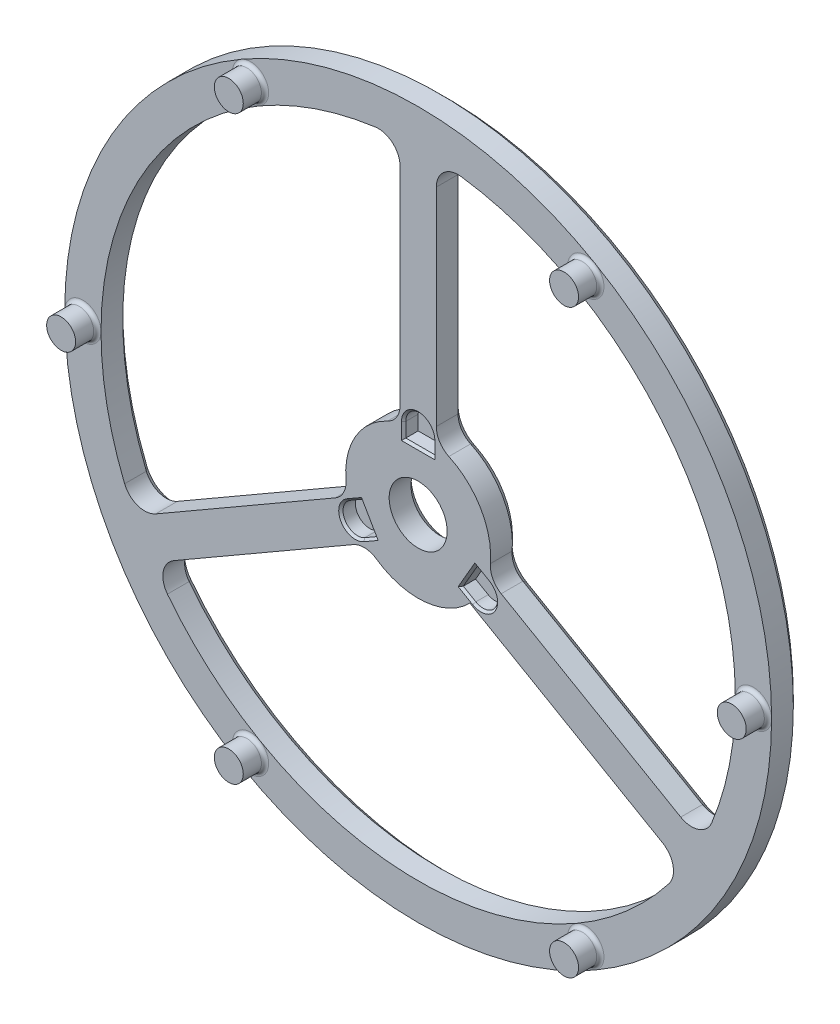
ISO-10303-21;
HEADER;
FILE_DESCRIPTION(('STEP AP214'),'2;1');
FILE_NAME('part.step','',(''),(''),'','','');
FILE_SCHEMA(('AUTOMOTIVE_DESIGN { 1 0 10303 214 1 1 1 1 }'));
ENDSEC;
DATA;
#1=APPLICATION_CONTEXT('core data for automotive mechanical design processes');
#2=APPLICATION_PROTOCOL_DEFINITION('international standard','automotive_design',2000,#1);
#3=PRODUCT_CONTEXT('',#1,'mechanical');
#4=PRODUCT('Part','Part','',(#3));
#5=PRODUCT_RELATED_PRODUCT_CATEGORY('part','',(#4));
#6=PRODUCT_DEFINITION_FORMATION('','',#4);
#7=PRODUCT_DEFINITION_CONTEXT('part definition',#1,'design');
#8=PRODUCT_DEFINITION('design','',#6,#7);
#9=PRODUCT_DEFINITION_SHAPE('','',#8);
#10=(LENGTH_UNIT() NAMED_UNIT(*) SI_UNIT(.MILLI.,.METRE.));
#11=(NAMED_UNIT(*) PLANE_ANGLE_UNIT() SI_UNIT($,.RADIAN.));
#12=(NAMED_UNIT(*) SI_UNIT($,.STERADIAN.) SOLID_ANGLE_UNIT());
#13=UNCERTAINTY_MEASURE_WITH_UNIT(LENGTH_MEASURE(1.E-05),#10,'distance_accuracy_value','');
#14=(GEOMETRIC_REPRESENTATION_CONTEXT(3) GLOBAL_UNCERTAINTY_ASSIGNED_CONTEXT((#13)) GLOBAL_UNIT_ASSIGNED_CONTEXT((#10,
#11,#12)) REPRESENTATION_CONTEXT('',''));
#15=CARTESIAN_POINT('',(0.,0.,0.));
#16=DIRECTION('',(0.,0.,1.));
#17=DIRECTION('',(1.,0.,0.));
#18=AXIS2_PLACEMENT_3D('',#15,#16,#17);
#19=CARTESIAN_POINT('',(0.,0.,8.));
#20=DIRECTION('',(0.,0.,1.));
#21=DIRECTION('',(1.,0.,0.));
#22=AXIS2_PLACEMENT_3D('',#19,#20,#21);
#23=PLANE('',#22);
#24=DIRECTION('',(0.,1.,0.));
#25=VECTOR('',#24,1.);
#26=CARTESIAN_POINT('',(-4.59999999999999,20.,8.));
#27=LINE('',#26,#25);
#28=CARTESIAN_POINT('',(-4.59999999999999,15.4,8.));
#29=VERTEX_POINT('',#28);
#30=CARTESIAN_POINT('',(-4.59999999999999,20.,8.));
#31=VERTEX_POINT('',#30);
#32=EDGE_CURVE('E1157',#29,#31,#27,.T.);
#33=ORIENTED_EDGE('',*,*,#32,.T.);
#34=CARTESIAN_POINT('',(0.,20.,8.));
#35=DIRECTION('',(0.,0.,1.));
#36=DIRECTION('',(1.,0.,0.));
#37=AXIS2_PLACEMENT_3D('',#34,#35,#36);
#38=CIRCLE('',#37,4.59999999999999);
#39=CARTESIAN_POINT('',(4.59999999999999,20.,8.));
#40=VERTEX_POINT('',#39);
#41=EDGE_CURVE('E1162',#31,#40,#38,.F.);
#42=ORIENTED_EDGE('',*,*,#41,.T.);
#43=DIRECTION('',(0.,-1.,0.));
#44=VECTOR('',#43,1.);
#45=CARTESIAN_POINT('',(4.59999999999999,16.,8.));
#46=LINE('',#45,#44);
#47=CARTESIAN_POINT('',(4.59999999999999,15.4,8.));
#48=VERTEX_POINT('',#47);
#49=EDGE_CURVE('E1159',#40,#48,#46,.T.);
#50=ORIENTED_EDGE('',*,*,#49,.T.);
#51=DIRECTION('',(-1.,0.,0.));
#52=VECTOR('',#51,1.);
#53=CARTESIAN_POINT('',(-4.,15.4,8.));
#54=LINE('',#53,#52);
#55=EDGE_CURVE('E1155',#48,#29,#54,.T.);
#56=ORIENTED_EDGE('',*,*,#55,.T.);
#57=EDGE_LOOP('',(#33,#42,#50,#56));
#58=FACE_BOUND('',#57,.T.);
#59=CARTESIAN_POINT('',(17.3205080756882,-9.99999999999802,8.));
#60=DIRECTION('',(0.,0.,1.));
#61=DIRECTION('',(1.,0.,0.));
#62=AXIS2_PLACEMENT_3D('',#59,#60,#61);
#63=CIRCLE('',#62,4.59999999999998);
#64=CARTESIAN_POINT('',(19.6205080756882,-6.01628314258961,8.));
#65=VERTEX_POINT('',#64);
#66=CARTESIAN_POINT('',(15.0205080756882,-13.9837168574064,8.));
#67=VERTEX_POINT('',#66);
#68=EDGE_CURVE('E1150',#65,#67,#63,.F.);
#69=ORIENTED_EDGE('',*,*,#68,.T.);
#70=DIRECTION('',(-0.866025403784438,0.500000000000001,0.));
#71=VECTOR('',#70,1.);
#72=CARTESIAN_POINT('',(11.5564064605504,-11.9837168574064,8.));
#73=LINE('',#72,#71);
#74=CARTESIAN_POINT('',(11.0367912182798,-11.6837168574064,8.));
#75=VERTEX_POINT('',#74);
#76=EDGE_CURVE('E1152',#67,#75,#73,.T.);
#77=ORIENTED_EDGE('',*,*,#76,.T.);
#78=DIRECTION('',(0.5,0.866025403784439,0.));
#79=VECTOR('',#78,1.);
#80=CARTESIAN_POINT('',(15.3367912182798,-4.23589838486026,8.));
#81=LINE('',#80,#79);
#82=CARTESIAN_POINT('',(15.6367912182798,-3.71628314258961,8.));
#83=VERTEX_POINT('',#82);
#84=EDGE_CURVE('E1146',#75,#83,#81,.T.);
#85=ORIENTED_EDGE('',*,*,#84,.T.);
#86=DIRECTION('',(0.866025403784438,-0.500000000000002,0.));
#87=VECTOR('',#86,1.);
#88=CARTESIAN_POINT('',(19.6205080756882,-6.01628314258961,8.));
#89=LINE('',#88,#87);
#90=EDGE_CURVE('E1148',#83,#65,#89,.T.);
#91=ORIENTED_EDGE('',*,*,#90,.T.);
#92=EDGE_LOOP('',(#69,#77,#85,#91));
#93=FACE_BOUND('',#92,.T.);
#94=DIRECTION('',(0.5,-0.866025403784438,0.));
#95=VECTOR('',#94,1.);
#96=CARTESIAN_POINT('',(-11.336791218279,-11.1641016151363,8.));
#97=LINE('',#96,#95);
#98=CARTESIAN_POINT('',(-15.636791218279,-3.71628314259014,8.));
#99=VERTEX_POINT('',#98);
#100=CARTESIAN_POINT('',(-11.036791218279,-11.6837168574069,8.));
#101=VERTEX_POINT('',#100);
#102=EDGE_CURVE('E1139',#99,#101,#97,.T.);
#103=ORIENTED_EDGE('',*,*,#102,.T.);
#104=DIRECTION('',(-0.866025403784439,-0.499999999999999,0.));
#105=VECTOR('',#104,1.);
#106=CARTESIAN_POINT('',(-15.0205080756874,-13.9837168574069,8.));
#107=LINE('',#106,#105);
#108=CARTESIAN_POINT('',(-15.0205080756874,-13.9837168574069,8.));
#109=VERTEX_POINT('',#108);
#110=EDGE_CURVE('E1143',#101,#109,#107,.T.);
#111=ORIENTED_EDGE('',*,*,#110,.T.);
#112=CARTESIAN_POINT('',(-17.3205080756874,-9.99999999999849,8.));
#113=DIRECTION('',(0.,0.,1.));
#114=DIRECTION('',(1.,0.,0.));
#115=AXIS2_PLACEMENT_3D('',#112,#113,#114);
#116=CIRCLE('',#115,4.59999999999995);
#117=CARTESIAN_POINT('',(-19.6205080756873,-6.01628314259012,8.));
#118=VERTEX_POINT('',#117);
#119=EDGE_CURVE('E1141',#109,#118,#116,.F.);
#120=ORIENTED_EDGE('',*,*,#119,.T.);
#121=DIRECTION('',(0.866025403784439,0.499999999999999,0.));
#122=VECTOR('',#121,1.);
#123=CARTESIAN_POINT('',(-16.1564064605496,-4.01628314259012,8.));
#124=LINE('',#123,#122);
#125=EDGE_CURVE('E1137',#118,#99,#124,.T.);
#126=ORIENTED_EDGE('',*,*,#125,.T.);
#127=EDGE_LOOP('',(#103,#111,#120,#126));
#128=FACE_BOUND('',#127,.T.);
#129=CARTESIAN_POINT('',(0.,0.,8.));
#130=DIRECTION('',(0.,0.,1.));
#131=DIRECTION('',(1.,0.,0.));
#132=AXIS2_PLACEMENT_3D('',#129,#130,#131);
#133=CIRCLE('',#132,8.);
#134=CARTESIAN_POINT('',(8.,0.,8.));
#135=VERTEX_POINT('',#134);
#136=EDGE_CURVE('E546',#135,#135,#133,.T.);
#137=ORIENTED_EDGE('',*,*,#136,.F.);
#138=EDGE_LOOP('',(#137));
#139=FACE_BOUND('',#138,.T.);
#140=CARTESIAN_POINT('',(0.,0.,8.));
#141=DIRECTION('',(0.,0.,1.));
#142=DIRECTION('',(1.,0.,0.));
#143=AXIS2_PLACEMENT_3D('',#140,#141,#142);
#144=CIRCLE('',#143,97.5);
#145=CARTESIAN_POINT('',(48.7500000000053,-84.4374768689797,8.));
#146=VERTEX_POINT('',#145);
#147=CARTESIAN_POINT('',(97.5,-3.79185049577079E-13,8.));
#148=VERTEX_POINT('',#147);
#149=EDGE_CURVE('E549',#146,#148,#144,.T.);
#150=ORIENTED_EDGE('',*,*,#149,.T.);
#151=CARTESIAN_POINT('',(92.5,-3.5973966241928E-13,8.));
#152=DIRECTION('',(0.,0.,1.));
#153=DIRECTION('',(1.,0.,0.));
#154=AXIS2_PLACEMENT_3D('',#151,#152,#153);
#155=CIRCLE('',#154,4.99999999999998);
#156=CARTESIAN_POINT('',(87.5000000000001,-3.40294275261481E-13,8.));
#157=VERTEX_POINT('',#156);
#158=EDGE_CURVE('E585',#148,#157,#155,.F.);
#159=ORIENTED_EDGE('',*,*,#158,.T.);
#160=CARTESIAN_POINT('',(0.,0.,8.));
#161=DIRECTION('',(0.,0.,1.));
#162=DIRECTION('',(1.,0.,0.));
#163=AXIS2_PLACEMENT_3D('',#160,#161,#162);
#164=CIRCLE('',#163,87.5);
#165=CARTESIAN_POINT('',(80.9887523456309,-33.1220771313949,8.));
#166=VERTEX_POINT('',#165);
#167=EDGE_CURVE('E521',#166,#157,#164,.T.);
#168=ORIENTED_EDGE('',*,*,#167,.F.);
#169=CARTESIAN_POINT('',(75.4352378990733,-30.8508489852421,8.));
#170=DIRECTION('',(0.,0.,1.));
#171=DIRECTION('',(1.,0.,0.));
#172=AXIS2_PLACEMENT_3D('',#169,#170,#171);
#173=CIRCLE('',#172,6.);
#174=CARTESIAN_POINT('',(72.4352378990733,-36.0470014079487,8.));
#175=VERTEX_POINT('',#174);
#176=EDGE_CURVE('E658',#166,#175,#173,.F.);
#177=ORIENTED_EDGE('',*,*,#176,.T.);
#178=DIRECTION('',(0.866025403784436,-0.500000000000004,0.));
#179=VECTOR('',#178,1.);
#180=CARTESIAN_POINT('',(78.1534037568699,-39.3483860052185,8.));
#181=LINE('',#180,#179);
#182=CARTESIAN_POINT('',(22.9022057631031,-7.44909197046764,8.));
#183=VERTEX_POINT('',#182);
#184=EDGE_CURVE('E530',#183,#175,#181,.T.);
#185=ORIENTED_EDGE('',*,*,#184,.F.);
#186=CARTESIAN_POINT('',(25.9022057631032,-2.25293954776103,8.));
#187=DIRECTION('',(0.,0.,1.));
#188=DIRECTION('',(1.,0.,0.));
#189=AXIS2_PLACEMENT_3D('',#186,#187,#188);
#190=CIRCLE('',#189,6.);
#191=CARTESIAN_POINT('',(19.9247736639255,-1.73303042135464,8.));
#192=VERTEX_POINT('',#191);
#193=EDGE_CURVE('E670',#183,#192,#190,.F.);
#194=ORIENTED_EDGE('',*,*,#193,.T.);
#195=CARTESIAN_POINT('',(0.,0.,8.));
#196=DIRECTION('',(0.,0.,-1.));
#197=DIRECTION('',(1.,0.,0.));
#198=AXIS2_PLACEMENT_3D('',#195,#196,#197);
#199=CIRCLE('',#198,20.);
#200=CARTESIAN_POINT('',(8.46153846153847,18.1218753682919,8.));
#201=VERTEX_POINT('',#200);
#202=EDGE_CURVE('E527',#201,#192,#199,.T.);
#203=ORIENTED_EDGE('',*,*,#202,.F.);
#204=CARTESIAN_POINT('',(11.,23.5584379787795,8.));
#205=DIRECTION('',(0.,0.,1.));
#206=DIRECTION('',(1.,0.,0.));
#207=AXIS2_PLACEMENT_3D('',#204,#205,#206);
#208=CIRCLE('',#207,6.);
#209=CARTESIAN_POINT('',(5.00000000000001,23.5584379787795,8.));
#210=VERTEX_POINT('',#209);
#211=EDGE_CURVE('E672',#201,#210,#208,.F.);
#212=ORIENTED_EDGE('',*,*,#211,.T.);
#213=DIRECTION('',(0.,-1.,0.));
#214=VECTOR('',#213,1.);
#215=CARTESIAN_POINT('',(5.,87.3570260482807,8.));
#216=LINE('',#215,#214);
#217=CARTESIAN_POINT('',(5.,80.7542568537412,8.));
#218=VERTEX_POINT('',#217);
#219=EDGE_CURVE('E523',#218,#210,#216,.T.);
#220=ORIENTED_EDGE('',*,*,#219,.F.);
#221=CARTESIAN_POINT('',(11.,80.7542568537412,8.));
#222=DIRECTION('',(0.,0.,1.));
#223=DIRECTION('',(1.,0.,0.));
#224=AXIS2_PLACEMENT_3D('',#221,#222,#223);
#225=CIRCLE('',#224,6.);
#226=CARTESIAN_POINT('',(11.8098159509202,86.6993555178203,8.));
#227=VERTEX_POINT('',#226);
#228=EDGE_CURVE('E678',#218,#227,#225,.F.);
#229=ORIENTED_EDGE('',*,*,#228,.T.);
#230=CARTESIAN_POINT('',(43.7500000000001,75.7772228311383,8.));
#231=VERTEX_POINT('',#230);
#232=EDGE_CURVE('E520',#231,#227,#164,.T.);
#233=ORIENTED_EDGE('',*,*,#232,.F.);
#234=CARTESIAN_POINT('',(46.2500000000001,80.1073498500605,8.));
#235=DIRECTION('',(0.,0.,1.));
#236=DIRECTION('',(1.,0.,0.));
#237=AXIS2_PLACEMENT_3D('',#234,#235,#236);
#238=CIRCLE('',#237,4.99999999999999);
#239=CARTESIAN_POINT('',(48.7500000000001,84.4374768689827,8.));
#240=VERTEX_POINT('',#239);
#241=EDGE_CURVE('E580',#231,#240,#238,.F.);
#242=ORIENTED_EDGE('',*,*,#241,.T.);
#243=CARTESIAN_POINT('',(-48.7499999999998,84.4374768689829,8.));
#244=VERTEX_POINT('',#243);
#245=EDGE_CURVE('E554',#240,#244,#144,.T.);
#246=ORIENTED_EDGE('',*,*,#245,.T.);
#247=CARTESIAN_POINT('',(-46.2499999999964,80.1073498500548,8.));
#248=DIRECTION('',(0.,0.,1.));
#249=DIRECTION('',(1.,0.,0.));
#250=AXIS2_PLACEMENT_3D('',#247,#248,#249);
#251=CIRCLE('',#250,5.0000000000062);
#252=CARTESIAN_POINT('',(-43.7499999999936,75.7772228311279,8.));
#253=VERTEX_POINT('',#252);
#254=EDGE_CURVE('E557',#244,#253,#251,.F.);
#255=ORIENTED_EDGE('',*,*,#254,.T.);
#256=CARTESIAN_POINT('',(0.,0.,8.));
#257=DIRECTION('',(0.,0.,1.));
#258=DIRECTION('',(1.,0.,0.));
#259=AXIS2_PLACEMENT_3D('',#256,#257,#258);
#260=CIRCLE('',#259,87.4999999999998);
#261=CARTESIAN_POINT('',(-11.8098159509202,86.69935551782,8.));
#262=VERTEX_POINT('',#261);
#263=EDGE_CURVE('E534',#262,#253,#260,.T.);
#264=ORIENTED_EDGE('',*,*,#263,.F.);
#265=CARTESIAN_POINT('',(-11.,80.7542568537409,8.));
#266=DIRECTION('',(0.,0.,1.));
#267=DIRECTION('',(1.,0.,0.));
#268=AXIS2_PLACEMENT_3D('',#265,#266,#267);
#269=CIRCLE('',#268,6.);
#270=CARTESIAN_POINT('',(-5.,80.7542568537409,8.));
#271=VERTEX_POINT('',#270);
#272=EDGE_CURVE('E676',#262,#271,#269,.F.);
#273=ORIENTED_EDGE('',*,*,#272,.T.);
#274=DIRECTION('',(0.,1.,0.));
#275=VECTOR('',#274,1.);
#276=CARTESIAN_POINT('',(-5.,87.3570260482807,8.));
#277=LINE('',#276,#275);
#278=CARTESIAN_POINT('',(-5.00000000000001,23.5584379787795,8.));
#279=VERTEX_POINT('',#278);
#280=EDGE_CURVE('E543',#279,#271,#277,.T.);
#281=ORIENTED_EDGE('',*,*,#280,.F.);
#282=CARTESIAN_POINT('',(-11.,23.5584379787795,8.));
#283=DIRECTION('',(0.,0.,1.));
#284=DIRECTION('',(1.,0.,0.));
#285=AXIS2_PLACEMENT_3D('',#282,#283,#284);
#286=CIRCLE('',#285,6.);
#287=CARTESIAN_POINT('',(-8.46153846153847,18.1218753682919,8.));
#288=VERTEX_POINT('',#287);
#289=EDGE_CURVE('E674',#279,#288,#286,.F.);
#290=ORIENTED_EDGE('',*,*,#289,.T.);
#291=CARTESIAN_POINT('',(0.,0.,8.));
#292=DIRECTION('',(0.,0.,-1.));
#293=DIRECTION('',(1.,0.,0.));
#294=AXIS2_PLACEMENT_3D('',#291,#292,#293);
#295=CIRCLE('',#294,20.);
#296=CARTESIAN_POINT('',(-19.9247736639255,-1.73303042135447,8.));
#297=VERTEX_POINT('',#296);
#298=EDGE_CURVE('E540',#297,#288,#295,.T.);
#299=ORIENTED_EDGE('',*,*,#298,.F.);
#300=CARTESIAN_POINT('',(-25.9022057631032,-2.25293954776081,8.));
#301=DIRECTION('',(0.,0.,1.));
#302=DIRECTION('',(1.,0.,0.));
#303=AXIS2_PLACEMENT_3D('',#300,#301,#302);
#304=CIRCLE('',#303,6.);
#305=CARTESIAN_POINT('',(-22.9022057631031,-7.44909197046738,8.));
#306=VERTEX_POINT('',#305);
#307=EDGE_CURVE('E668',#297,#306,#304,.F.);
#308=ORIENTED_EDGE('',*,*,#307,.T.);
#309=DIRECTION('',(0.866025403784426,0.500000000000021,0.));
#310=VECTOR('',#309,1.);
#311=CARTESIAN_POINT('',(-78.153403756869,-39.3483860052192,8.));
#312=LINE('',#311,#310);
#313=CARTESIAN_POINT('',(-72.4352378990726,-36.0470014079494,8.));
#314=VERTEX_POINT('',#313);
#315=EDGE_CURVE('E536',#314,#306,#312,.T.);
#316=ORIENTED_EDGE('',*,*,#315,.F.);
#317=CARTESIAN_POINT('',(-75.4352378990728,-30.8508489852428,8.));
#318=DIRECTION('',(0.,0.,1.));
#319=DIRECTION('',(1.,0.,0.));
#320=AXIS2_PLACEMENT_3D('',#317,#318,#319);
#321=CIRCLE('',#320,6.);
#322=CARTESIAN_POINT('',(-80.9887523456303,-33.1220771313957,8.));
#323=VERTEX_POINT('',#322);
#324=EDGE_CURVE('E664',#314,#323,#321,.F.);
#325=ORIENTED_EDGE('',*,*,#324,.T.);
#326=CARTESIAN_POINT('',(-87.4999999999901,-5.5062475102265E-12,8.));
#327=VERTEX_POINT('',#326);
#328=EDGE_CURVE('E533',#327,#323,#260,.T.);
#329=ORIENTED_EDGE('',*,*,#328,.F.);
#330=CARTESIAN_POINT('',(-92.4999999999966,-5.82089022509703E-12,8.));
#331=DIRECTION('',(0.,0.,1.));
#332=DIRECTION('',(1.,0.,0.));
#333=AXIS2_PLACEMENT_3D('',#330,#331,#332);
#334=CIRCLE('',#333,5.00000000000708);
#335=CARTESIAN_POINT('',(-97.5,-6.13553293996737E-12,8.));
#336=VERTEX_POINT('',#335);
#337=EDGE_CURVE('E565',#327,#336,#334,.F.);
#338=ORIENTED_EDGE('',*,*,#337,.T.);
#339=CARTESIAN_POINT('',(-48.7499999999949,-84.4374768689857,8.));
#340=VERTEX_POINT('',#339);
#341=EDGE_CURVE('E1086',#336,#340,#144,.T.);
#342=ORIENTED_EDGE('',*,*,#341,.T.);
#343=CARTESIAN_POINT('',(-46.2499999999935,-80.1073498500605,8.));
#344=DIRECTION('',(0.,0.,1.));
#345=DIRECTION('',(1.,0.,0.));
#346=AXIS2_PLACEMENT_3D('',#343,#344,#345);
#347=CIRCLE('',#346,5.0000000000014);
#348=CARTESIAN_POINT('',(-43.7499999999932,-75.7772228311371,8.));
#349=VERTEX_POINT('',#348);
#350=EDGE_CURVE('E570',#340,#349,#347,.F.);
#351=ORIENTED_EDGE('',*,*,#350,.T.);
#352=CARTESIAN_POINT('',(0.,0.,8.));
#353=DIRECTION('',(0.,0.,1.));
#354=DIRECTION('',(1.,0.,0.));
#355=AXIS2_PLACEMENT_3D('',#352,#353,#354);
#356=CIRCLE('',#355,87.4999999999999);
#357=CARTESIAN_POINT('',(-69.1789363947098,-53.5772783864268,8.));
#358=VERTEX_POINT('',#357);
#359=EDGE_CURVE('E506',#358,#349,#356,.T.);
#360=ORIENTED_EDGE('',*,*,#359,.F.);
#361=CARTESIAN_POINT('',(-64.4352378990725,-49.9034078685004,8.));
#362=DIRECTION('',(0.,0.,1.));
#363=DIRECTION('',(1.,0.,0.));
#364=AXIS2_PLACEMENT_3D('',#361,#362,#363);
#365=CIRCLE('',#364,6.);
#366=CARTESIAN_POINT('',(-67.4352378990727,-44.7072554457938,8.));
#367=VERTEX_POINT('',#366);
#368=EDGE_CURVE('E662',#358,#367,#365,.F.);
#369=ORIENTED_EDGE('',*,*,#368,.T.);
#370=DIRECTION('',(-0.866025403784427,-0.50000000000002,0.));
#371=VECTOR('',#370,1.);
#372=CARTESIAN_POINT('',(-73.153403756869,-48.0086400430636,8.));
#373=LINE('',#372,#371);
#374=CARTESIAN_POINT('',(-17.9022057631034,-16.109346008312,8.));
#375=VERTEX_POINT('',#374);
#376=EDGE_CURVE('E514',#375,#367,#373,.T.);
#377=ORIENTED_EDGE('',*,*,#376,.F.);
#378=CARTESIAN_POINT('',(-14.9022057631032,-21.3054984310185,8.));
#379=DIRECTION('',(0.,0.,1.));
#380=DIRECTION('',(1.,0.,0.));
#381=AXIS2_PLACEMENT_3D('',#378,#379,#380);
#382=CIRCLE('',#381,6.);
#383=CARTESIAN_POINT('',(-11.4632352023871,-16.3888449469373,8.));
#384=VERTEX_POINT('',#383);
#385=EDGE_CURVE('E666',#375,#384,#382,.F.);
#386=ORIENTED_EDGE('',*,*,#385,.T.);
#387=CARTESIAN_POINT('',(0.,0.,8.));
#388=DIRECTION('',(0.,0.,-1.));
#389=DIRECTION('',(1.,0.,0.));
#390=AXIS2_PLACEMENT_3D('',#387,#388,#389);
#391=CIRCLE('',#390,20.);
#392=CARTESIAN_POINT('',(14.2705098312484,-14.0125853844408,8.));
#393=VERTEX_POINT('',#392);
#394=EDGE_CURVE('E511',#393,#384,#391,.T.);
#395=ORIENTED_EDGE('',*,*,#394,.F.);
#396=DIRECTION('',(-0.866025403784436,0.500000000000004,0.));
#397=VECTOR('',#396,1.);
#398=CARTESIAN_POINT('',(73.1534037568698,-48.0086400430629,8.));
#399=LINE('',#398,#397);
#400=CARTESIAN_POINT('',(67.4352378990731,-44.707255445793,8.));
#401=VERTEX_POINT('',#400);
#402=EDGE_CURVE('E508',#401,#393,#399,.T.);
#403=ORIENTED_EDGE('',*,*,#402,.F.);
#404=CARTESIAN_POINT('',(64.4352378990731,-49.9034078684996,8.));
#405=DIRECTION('',(0.,0.,1.));
#406=DIRECTION('',(1.,0.,0.));
#407=AXIS2_PLACEMENT_3D('',#404,#405,#406);
#408=CIRCLE('',#407,6.);
#409=CARTESIAN_POINT('',(69.1789363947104,-53.577278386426,8.));
#410=VERTEX_POINT('',#409);
#411=EDGE_CURVE('E660',#401,#410,#408,.F.);
#412=ORIENTED_EDGE('',*,*,#411,.T.);
#413=CARTESIAN_POINT('',(43.7500000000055,-75.7772228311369,8.));
#414=VERTEX_POINT('',#413);
#415=EDGE_CURVE('E505',#414,#410,#356,.T.);
#416=ORIENTED_EDGE('',*,*,#415,.F.);
#417=CARTESIAN_POINT('',(46.2500000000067,-80.1073498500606,8.));
#418=DIRECTION('',(0.,0.,1.));
#419=DIRECTION('',(1.,0.,0.));
#420=AXIS2_PLACEMENT_3D('',#417,#418,#419);
#421=CIRCLE('',#420,5.00000000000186);
#422=EDGE_CURVE('E573',#414,#146,#421,.F.);
#423=ORIENTED_EDGE('',*,*,#422,.T.);
#424=EDGE_LOOP('',(#150,#159,#168,#177,#185,#194,#203,#212,#220,#229,#233,#242,#246,#255,#264,
#273,#281,#290,#299,#308,#316,#325,#329,#338,#342,#351,#360,#369,#377,#386,#395,#403,#412,#416,#423));
#425=FACE_BOUND('',#424,.T.);
#426=ADVANCED_FACE('F34',(#58,#93,#128,#139,#425),#23,.T.);
#427=EDGE_CURVE('E1088',#340,#146,#144,.T.);
#428=ORIENTED_EDGE('',*,*,#427,.T.);
#429=CARTESIAN_POINT('',(46.2500000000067,-80.1073498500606,8.));
#430=DIRECTION('',(0.,0.,1.));
#431=DIRECTION('',(1.,0.,0.));
#432=AXIS2_PLACEMENT_3D('',#429,#430,#431);
#433=CIRCLE('',#432,5.00000000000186);
#434=EDGE_CURVE('E575',#146,#414,#433,.F.);
#435=ORIENTED_EDGE('',*,*,#434,.T.);
#436=EDGE_CURVE('E509',#349,#414,#356,.T.);
#437=ORIENTED_EDGE('',*,*,#436,.F.);
#438=CARTESIAN_POINT('',(-46.2499999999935,-80.1073498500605,8.));
#439=DIRECTION('',(0.,0.,1.));
#440=DIRECTION('',(1.,0.,0.));
#441=AXIS2_PLACEMENT_3D('',#438,#439,#440);
#442=CIRCLE('',#441,5.0000000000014);
#443=EDGE_CURVE('E568',#349,#340,#442,.F.);
#444=ORIENTED_EDGE('',*,*,#443,.T.);
#445=EDGE_LOOP('',(#428,#435,#437,#444));
#446=FACE_BOUND('',#445,.T.);
#447=ADVANCED_FACE('F1054',(#446),#23,.T.);
#448=EDGE_CURVE('E524',#157,#231,#164,.T.);
#449=ORIENTED_EDGE('',*,*,#448,.F.);
#450=CARTESIAN_POINT('',(92.5,-3.5973966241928E-13,8.));
#451=DIRECTION('',(0.,0.,1.));
#452=DIRECTION('',(1.,0.,0.));
#453=AXIS2_PLACEMENT_3D('',#450,#451,#452);
#454=CIRCLE('',#453,4.99999999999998);
#455=EDGE_CURVE('E583',#157,#148,#454,.F.);
#456=ORIENTED_EDGE('',*,*,#455,.T.);
#457=EDGE_CURVE('E550',#148,#240,#144,.T.);
#458=ORIENTED_EDGE('',*,*,#457,.T.);
#459=CARTESIAN_POINT('',(46.2500000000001,80.1073498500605,8.));
#460=DIRECTION('',(0.,0.,1.));
#461=DIRECTION('',(1.,0.,0.));
#462=AXIS2_PLACEMENT_3D('',#459,#460,#461);
#463=CIRCLE('',#462,4.99999999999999);
#464=EDGE_CURVE('E578',#240,#231,#463,.F.);
#465=ORIENTED_EDGE('',*,*,#464,.T.);
#466=EDGE_LOOP('',(#449,#456,#458,#465));
#467=FACE_BOUND('',#466,.T.);
#468=ADVANCED_FACE('F1061',(#467),#23,.T.);
#469=EDGE_CURVE('E1078',#244,#336,#144,.T.);
#470=ORIENTED_EDGE('',*,*,#469,.T.);
#471=CARTESIAN_POINT('',(-92.4999999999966,-5.82089022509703E-12,8.));
#472=DIRECTION('',(0.,0.,1.));
#473=DIRECTION('',(1.,0.,0.));
#474=AXIS2_PLACEMENT_3D('',#471,#472,#473);
#475=CIRCLE('',#474,5.00000000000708);
#476=EDGE_CURVE('E563',#336,#327,#475,.F.);
#477=ORIENTED_EDGE('',*,*,#476,.T.);
#478=EDGE_CURVE('E537',#253,#327,#260,.T.);
#479=ORIENTED_EDGE('',*,*,#478,.F.);
#480=CARTESIAN_POINT('',(-46.2499999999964,80.1073498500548,8.));
#481=DIRECTION('',(0.,0.,1.));
#482=DIRECTION('',(1.,0.,0.));
#483=AXIS2_PLACEMENT_3D('',#480,#481,#482);
#484=CIRCLE('',#483,5.0000000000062);
#485=EDGE_CURVE('E560',#253,#244,#484,.F.);
#486=ORIENTED_EDGE('',*,*,#485,.T.);
#487=EDGE_LOOP('',(#470,#477,#479,#486));
#488=FACE_BOUND('',#487,.T.);
#489=ADVANCED_FACE('F1057',(#488),#23,.T.);
#490=CARTESIAN_POINT('',(0.,0.,0.));
#491=DIRECTION('',(0.,0.,1.));
#492=DIRECTION('',(1.,0.,0.));
#493=AXIS2_PLACEMENT_3D('',#490,#491,#492);
#494=PLANE('',#493);
#495=CARTESIAN_POINT('',(0.,0.,0.));
#496=DIRECTION('',(0.,0.,1.));
#497=DIRECTION('',(1.,0.,0.));
#498=AXIS2_PLACEMENT_3D('',#495,#496,#497);
#499=CIRCLE('',#498,18.);
#500=CARTESIAN_POINT('',(13.8704261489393,-11.4721958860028,0.));
#501=VERTEX_POINT('',#500);
#502=CARTESIAN_POINT('',(-10.3169116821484,-14.7499604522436,0.));
#503=VERTEX_POINT('',#502);
#504=EDGE_CURVE('E730',#501,#503,#499,.F.);
#505=ORIENTED_EDGE('',*,*,#504,.T.);
#506=CARTESIAN_POINT('',(-14.9022057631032,-21.3054984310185,0.));
#507=DIRECTION('',(0.,0.,1.));
#508=DIRECTION('',(1.,0.,0.));
#509=AXIS2_PLACEMENT_3D('',#506,#507,#508);
#510=CIRCLE('',#509,8.);
#511=CARTESIAN_POINT('',(-18.9022057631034,-14.3772952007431,0.));
#512=VERTEX_POINT('',#511);
#513=EDGE_CURVE('E732',#503,#512,#510,.T.);
#514=ORIENTED_EDGE('',*,*,#513,.T.);
#515=DIRECTION('',(-0.866025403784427,-0.50000000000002,0.));
#516=VECTOR('',#515,1.);
#517=CARTESIAN_POINT('',(-68.4352378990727,-42.9752046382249,0.));
#518=LINE('',#517,#516);
#519=CARTESIAN_POINT('',(-68.4352378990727,-42.9752046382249,0.));
#520=VERTEX_POINT('',#519);
#521=EDGE_CURVE('E720',#512,#520,#518,.T.);
#522=ORIENTED_EDGE('',*,*,#521,.T.);
#523=CARTESIAN_POINT('',(-64.4352378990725,-49.9034078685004,0.));
#524=DIRECTION('',(0.,0.,1.));
#525=DIRECTION('',(1.,0.,0.));
#526=AXIS2_PLACEMENT_3D('',#523,#524,#525);
#527=CIRCLE('',#526,8.);
#528=CARTESIAN_POINT('',(-70.7601692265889,-54.8019018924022,0.));
#529=VERTEX_POINT('',#528);
#530=EDGE_CURVE('E722',#520,#529,#527,.T.);
#531=ORIENTED_EDGE('',*,*,#530,.T.);
#532=CARTESIAN_POINT('',(0.,0.,0.));
#533=DIRECTION('',(0.,0.,1.));
#534=DIRECTION('',(1.,0.,0.));
#535=AXIS2_PLACEMENT_3D('',#532,#533,#534);
#536=CIRCLE('',#535,89.4999999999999);
#537=CARTESIAN_POINT('',(70.7601692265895,-54.8019018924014,0.));
#538=VERTEX_POINT('',#537);
#539=EDGE_CURVE('E724',#529,#538,#536,.T.);
#540=ORIENTED_EDGE('',*,*,#539,.T.);
#541=CARTESIAN_POINT('',(64.4352378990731,-49.9034078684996,0.));
#542=DIRECTION('',(0.,0.,1.));
#543=DIRECTION('',(1.,0.,0.));
#544=AXIS2_PLACEMENT_3D('',#541,#542,#543);
#545=CIRCLE('',#544,8.);
#546=CARTESIAN_POINT('',(68.4352378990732,-42.9752046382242,0.));
#547=VERTEX_POINT('',#546);
#548=EDGE_CURVE('E726',#538,#547,#545,.T.);
#549=ORIENTED_EDGE('',*,*,#548,.T.);
#550=DIRECTION('',(-0.866025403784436,0.500000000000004,0.));
#551=VECTOR('',#550,1.);
#552=CARTESIAN_POINT('',(15.2705098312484,-12.2805345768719,0.));
#553=LINE('',#552,#551);
#554=EDGE_CURVE('E728',#547,#501,#553,.T.);
#555=ORIENTED_EDGE('',*,*,#554,.T.);
#556=EDGE_LOOP('',(#505,#514,#522,#531,#540,#549,#555));
#557=FACE_BOUND('',#556,.T.);
#558=CARTESIAN_POINT('',(0.,0.,0.));
#559=DIRECTION('',(0.,0.,1.));
#560=DIRECTION('',(1.,0.,0.));
#561=AXIS2_PLACEMENT_3D('',#558,#559,#560);
#562=CIRCLE('',#561,18.);
#563=CARTESIAN_POINT('',(-17.932296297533,-1.55972737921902,0.));
#564=VERTEX_POINT('',#563);
#565=CARTESIAN_POINT('',(-7.61538461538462,16.3096878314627,0.));
#566=VERTEX_POINT('',#565);
#567=EDGE_CURVE('E715',#564,#566,#562,.F.);
#568=ORIENTED_EDGE('',*,*,#567,.T.);
#569=CARTESIAN_POINT('',(-11.,23.5584379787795,0.));
#570=DIRECTION('',(0.,0.,1.));
#571=DIRECTION('',(1.,0.,0.));
#572=AXIS2_PLACEMENT_3D('',#569,#570,#571);
#573=CIRCLE('',#572,8.);
#574=CARTESIAN_POINT('',(-3.00000000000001,23.5584379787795,0.));
#575=VERTEX_POINT('',#574);
#576=EDGE_CURVE('E717',#566,#575,#573,.T.);
#577=ORIENTED_EDGE('',*,*,#576,.T.);
#578=DIRECTION('',(0.,1.,0.));
#579=VECTOR('',#578,1.);
#580=CARTESIAN_POINT('',(-3.,80.7542568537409,0.));
#581=LINE('',#580,#579);
#582=CARTESIAN_POINT('',(-3.,80.7542568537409,0.));
#583=VERTEX_POINT('',#582);
#584=EDGE_CURVE('E703',#575,#583,#581,.T.);
#585=ORIENTED_EDGE('',*,*,#584,.T.);
#586=CARTESIAN_POINT('',(-11.,80.7542568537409,0.));
#587=DIRECTION('',(0.,0.,1.));
#588=DIRECTION('',(1.,0.,0.));
#589=AXIS2_PLACEMENT_3D('',#586,#587,#588);
#590=CIRCLE('',#589,8.);
#591=CARTESIAN_POINT('',(-12.079754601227,88.6810550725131,0.));
#592=VERTEX_POINT('',#591);
#593=EDGE_CURVE('E705',#583,#592,#590,.T.);
#594=ORIENTED_EDGE('',*,*,#593,.T.);
#595=CARTESIAN_POINT('',(0.,0.,0.));
#596=DIRECTION('',(0.,0.,1.));
#597=DIRECTION('',(1.,0.,0.));
#598=AXIS2_PLACEMENT_3D('',#595,#596,#597);
#599=CIRCLE('',#598,89.4999999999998);
#600=CARTESIAN_POINT('',(-82.8399238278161,-33.8791531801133,0.));
#601=VERTEX_POINT('',#600);
#602=EDGE_CURVE('E707',#592,#601,#599,.T.);
#603=ORIENTED_EDGE('',*,*,#602,.T.);
#604=CARTESIAN_POINT('',(-75.4352378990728,-30.8508489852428,0.));
#605=DIRECTION('',(0.,0.,1.));
#606=DIRECTION('',(1.,0.,0.));
#607=AXIS2_PLACEMENT_3D('',#604,#605,#606);
#608=CIRCLE('',#607,8.);
#609=CARTESIAN_POINT('',(-71.4352378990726,-37.7790522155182,0.));
#610=VERTEX_POINT('',#609);
#611=EDGE_CURVE('E709',#601,#610,#608,.T.);
#612=ORIENTED_EDGE('',*,*,#611,.T.);
#613=DIRECTION('',(0.866025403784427,0.500000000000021,0.));
#614=VECTOR('',#613,1.);
#615=CARTESIAN_POINT('',(-21.902205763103,-9.18114277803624,0.));
#616=LINE('',#615,#614);
#617=CARTESIAN_POINT('',(-21.902205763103,-9.18114277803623,0.));
#618=VERTEX_POINT('',#617);
#619=EDGE_CURVE('E711',#610,#618,#616,.T.);
#620=ORIENTED_EDGE('',*,*,#619,.T.);
#621=CARTESIAN_POINT('',(-25.9022057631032,-2.25293954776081,0.));
#622=DIRECTION('',(0.,0.,1.));
#623=DIRECTION('',(1.,0.,0.));
#624=AXIS2_PLACEMENT_3D('',#621,#622,#623);
#625=CIRCLE('',#624,8.);
#626=EDGE_CURVE('E713',#618,#564,#625,.T.);
#627=ORIENTED_EDGE('',*,*,#626,.T.);
#628=EDGE_LOOP('',(#568,#577,#585,#594,#603,#612,#620,#627));
#629=FACE_BOUND('',#628,.T.);
#630=CARTESIAN_POINT('',(0.,0.,0.));
#631=DIRECTION('',(0.,0.,1.));
#632=DIRECTION('',(1.,0.,0.));
#633=AXIS2_PLACEMENT_3D('',#630,#631,#632);
#634=CIRCLE('',#633,95.5);
#635=CARTESIAN_POINT('',(95.5,0.,0.));
#636=VERTEX_POINT('',#635);
#637=EDGE_CURVE('E700',#636,#636,#634,.F.);
#638=ORIENTED_EDGE('',*,*,#637,.T.);
#639=EDGE_LOOP('',(#638));
#640=FACE_BOUND('',#639,.T.);
#641=CARTESIAN_POINT('',(0.,0.,0.));
#642=DIRECTION('',(0.,0.,1.));
#643=DIRECTION('',(1.,0.,0.));
#644=AXIS2_PLACEMENT_3D('',#641,#642,#643);
#645=CIRCLE('',#644,9.99999999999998);
#646=CARTESIAN_POINT('',(9.99999999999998,0.,0.));
#647=VERTEX_POINT('',#646);
#648=EDGE_CURVE('E697',#647,#647,#645,.T.);
#649=ORIENTED_EDGE('',*,*,#648,.T.);
#650=EDGE_LOOP('',(#649));
#651=FACE_BOUND('',#650,.T.);
#652=CARTESIAN_POINT('',(0.,0.,0.));
#653=DIRECTION('',(0.,0.,1.));
#654=DIRECTION('',(1.,0.,0.));
#655=AXIS2_PLACEMENT_3D('',#652,#653,#654);
#656=CIRCLE('',#655,18.);
#657=CARTESIAN_POINT('',(7.61538461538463,16.3096878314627,0.));
#658=VERTEX_POINT('',#657);
#659=CARTESIAN_POINT('',(17.932296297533,-1.55972737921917,0.));
#660=VERTEX_POINT('',#659);
#661=EDGE_CURVE('E692',#658,#660,#656,.F.);
#662=ORIENTED_EDGE('',*,*,#661,.T.);
#663=CARTESIAN_POINT('',(25.9022057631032,-2.25293954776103,0.));
#664=DIRECTION('',(0.,0.,1.));
#665=DIRECTION('',(1.,0.,0.));
#666=AXIS2_PLACEMENT_3D('',#663,#664,#665);
#667=CIRCLE('',#666,7.99999999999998);
#668=CARTESIAN_POINT('',(21.9022057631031,-9.1811427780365,0.));
#669=VERTEX_POINT('',#668);
#670=EDGE_CURVE('E694',#660,#669,#667,.T.);
#671=ORIENTED_EDGE('',*,*,#670,.T.);
#672=DIRECTION('',(0.866025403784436,-0.500000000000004,0.));
#673=VECTOR('',#672,1.);
#674=CARTESIAN_POINT('',(71.4352378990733,-37.7790522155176,0.));
#675=LINE('',#674,#673);
#676=CARTESIAN_POINT('',(71.4352378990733,-37.7790522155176,0.));
#677=VERTEX_POINT('',#676);
#678=EDGE_CURVE('E680',#669,#677,#675,.T.);
#679=ORIENTED_EDGE('',*,*,#678,.T.);
#680=CARTESIAN_POINT('',(75.4352378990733,-30.8508489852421,0.));
#681=DIRECTION('',(0.,0.,1.));
#682=DIRECTION('',(1.,0.,0.));
#683=AXIS2_PLACEMENT_3D('',#680,#681,#682);
#684=CIRCLE('',#683,7.99999999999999);
#685=CARTESIAN_POINT('',(82.8399238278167,-33.8791531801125,0.));
#686=VERTEX_POINT('',#685);
#687=EDGE_CURVE('E682',#677,#686,#684,.T.);
#688=ORIENTED_EDGE('',*,*,#687,.T.);
#689=CARTESIAN_POINT('',(0.,0.,0.));
#690=DIRECTION('',(0.,0.,1.));
#691=DIRECTION('',(1.,0.,0.));
#692=AXIS2_PLACEMENT_3D('',#689,#690,#691);
#693=CIRCLE('',#692,89.5);
#694=CARTESIAN_POINT('',(12.079754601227,88.6810550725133,0.));
#695=VERTEX_POINT('',#694);
#696=EDGE_CURVE('E684',#686,#695,#693,.T.);
#697=ORIENTED_EDGE('',*,*,#696,.T.);
#698=CARTESIAN_POINT('',(11.,80.7542568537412,0.));
#699=DIRECTION('',(0.,0.,1.));
#700=DIRECTION('',(1.,0.,0.));
#701=AXIS2_PLACEMENT_3D('',#698,#699,#700);
#702=CIRCLE('',#701,7.99999999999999);
#703=CARTESIAN_POINT('',(3.00000000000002,80.7542568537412,0.));
#704=VERTEX_POINT('',#703);
#705=EDGE_CURVE('E686',#695,#704,#702,.T.);
#706=ORIENTED_EDGE('',*,*,#705,.T.);
#707=DIRECTION('',(0.,-1.,0.));
#708=VECTOR('',#707,1.);
#709=CARTESIAN_POINT('',(3.00000000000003,23.5584379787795,0.));
#710=LINE('',#709,#708);
#711=CARTESIAN_POINT('',(3.00000000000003,23.5584379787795,0.));
#712=VERTEX_POINT('',#711);
#713=EDGE_CURVE('E688',#704,#712,#710,.T.);
#714=ORIENTED_EDGE('',*,*,#713,.T.);
#715=CARTESIAN_POINT('',(11.,23.5584379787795,0.));
#716=DIRECTION('',(0.,0.,1.));
#717=DIRECTION('',(1.,0.,0.));
#718=AXIS2_PLACEMENT_3D('',#715,#716,#717);
#719=CIRCLE('',#718,7.99999999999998);
#720=EDGE_CURVE('E690',#712,#658,#719,.T.);
#721=ORIENTED_EDGE('',*,*,#720,.T.);
#722=EDGE_LOOP('',(#662,#671,#679,#688,#697,#706,#714,#721));
#723=FACE_BOUND('',#722,.T.);
#724=ADVANCED_FACE('F1067',(#557,#629,#640,#651,#723),#494,.F.);
#725=CARTESIAN_POINT('',(0.,0.,8.));
#726=DIRECTION('',(0.,0.,-1.));
#727=DIRECTION('',(-1.,0.,0.));
#728=AXIS2_PLACEMENT_3D('',#725,#726,#727);
#729=CYLINDRICAL_SURFACE('',#728,97.5);
#730=CARTESIAN_POINT('',(0.,0.,2.));
#731=DIRECTION('',(0.,0.,1.));
#732=DIRECTION('',(1.,0.,0.));
#733=AXIS2_PLACEMENT_3D('',#730,#731,#732);
#734=CIRCLE('',#733,97.5);
#735=CARTESIAN_POINT('',(97.5,0.,2.));
#736=VERTEX_POINT('',#735);
#737=EDGE_CURVE('E767',#736,#736,#734,.T.);
#738=ORIENTED_EDGE('',*,*,#737,.T.);
#739=EDGE_LOOP('',(#738));
#740=FACE_BOUND('',#739,.T.);
#741=ORIENTED_EDGE('',*,*,#457,.F.);
#742=ORIENTED_EDGE('',*,*,#149,.F.);
#743=ORIENTED_EDGE('',*,*,#427,.F.);
#744=ORIENTED_EDGE('',*,*,#341,.F.);
#745=ORIENTED_EDGE('',*,*,#469,.F.);
#746=ORIENTED_EDGE('',*,*,#245,.F.);
#747=EDGE_LOOP('',(#741,#742,#743,#744,#745,#746));
#748=FACE_BOUND('',#747,.T.);
#749=ADVANCED_FACE('F1073',(#740,#748),#729,.T.);
#750=CARTESIAN_POINT('',(0.,0.,8.));
#751=DIRECTION('',(0.,0.,-1.));
#752=DIRECTION('',(-1.,0.,0.));
#753=AXIS2_PLACEMENT_3D('',#750,#751,#752);
#754=CYLINDRICAL_SURFACE('',#753,8.);
#755=CARTESIAN_POINT('',(0.,0.,1.99999999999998));
#756=DIRECTION('',(0.,0.,1.));
#757=DIRECTION('',(1.,0.,0.));
#758=AXIS2_PLACEMENT_3D('',#755,#756,#757);
#759=CIRCLE('',#758,8.);
#760=CARTESIAN_POINT('',(8.,0.,1.99999999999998));
#761=VERTEX_POINT('',#760);
#762=EDGE_CURVE('E770',#761,#761,#759,.F.);
#763=ORIENTED_EDGE('',*,*,#762,.T.);
#764=EDGE_LOOP('',(#763));
#765=FACE_BOUND('',#764,.T.);
#766=ORIENTED_EDGE('',*,*,#136,.T.);
#767=EDGE_LOOP('',(#766));
#768=FACE_BOUND('',#767,.T.);
#769=ADVANCED_FACE('F1336',(#765,#768),#754,.F.);
#770=CARTESIAN_POINT('',(0.,0.,8.));
#771=DIRECTION('',(0.,0.,-1.));
#772=DIRECTION('',(-1.,0.,0.));
#773=AXIS2_PLACEMENT_3D('',#770,#771,#772);
#774=CYLINDRICAL_SURFACE('',#773,87.4999999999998);
#775=DIRECTION('',(0.,0.,-1.));
#776=VECTOR('',#775,1.);
#777=CARTESIAN_POINT('',(-80.9887523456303,-33.1220771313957,8.));
#778=LINE('',#777,#776);
#779=CARTESIAN_POINT('',(-80.9887523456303,-33.1220771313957,2.));
#780=VERTEX_POINT('',#779);
#781=EDGE_CURVE('E627',#323,#780,#778,.T.);
#782=ORIENTED_EDGE('',*,*,#781,.T.);
#783=CARTESIAN_POINT('',(0.,0.,2.));
#784=DIRECTION('',(0.,0.,1.));
#785=DIRECTION('',(1.,0.,0.));
#786=AXIS2_PLACEMENT_3D('',#783,#784,#785);
#787=CIRCLE('',#786,87.4999999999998);
#788=CARTESIAN_POINT('',(-11.8098159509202,86.69935551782,2.));
#789=VERTEX_POINT('',#788);
#790=EDGE_CURVE('E761',#780,#789,#787,.F.);
#791=ORIENTED_EDGE('',*,*,#790,.T.);
#792=DIRECTION('',(0.,0.,-1.));
#793=VECTOR('',#792,1.);
#794=CARTESIAN_POINT('',(-11.8098159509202,86.69935551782,8.));
#795=LINE('',#794,#793);
#796=EDGE_CURVE('E625',#789,#262,#795,.F.);
#797=ORIENTED_EDGE('',*,*,#796,.T.);
#798=ORIENTED_EDGE('',*,*,#263,.T.);
#799=ORIENTED_EDGE('',*,*,#478,.T.);
#800=ORIENTED_EDGE('',*,*,#328,.T.);
#801=EDGE_LOOP('',(#782,#791,#797,#798,#799,#800));
#802=FACE_BOUND('',#801,.T.);
#803=ADVANCED_FACE('F1333',(#802),#774,.F.);
#804=CARTESIAN_POINT('',(-78.153403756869,-39.3483860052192,8.));
#805=DIRECTION('',(-0.500000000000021,0.866025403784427,0.));
#806=DIRECTION('',(-0.866025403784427,-0.500000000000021,0.));
#807=AXIS2_PLACEMENT_3D('',#804,#805,#806);
#808=PLANE('',#807);
#809=DIRECTION('',(0.,0.,1.));
#810=VECTOR('',#809,1.);
#811=CARTESIAN_POINT('',(-22.9022057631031,-7.44909197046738,0.));
#812=LINE('',#811,#810);
#813=CARTESIAN_POINT('',(-22.9022057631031,-7.44909197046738,2.));
#814=VERTEX_POINT('',#813);
#815=EDGE_CURVE('E630',#306,#814,#812,.F.);
#816=ORIENTED_EDGE('',*,*,#815,.T.);
#817=DIRECTION('',(-0.866025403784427,-0.500000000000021,0.));
#818=VECTOR('',#817,1.);
#819=CARTESIAN_POINT('',(-72.4352378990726,-36.0470014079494,2.));
#820=LINE('',#819,#818);
#821=CARTESIAN_POINT('',(-72.4352378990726,-36.0470014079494,2.));
#822=VERTEX_POINT('',#821);
#823=EDGE_CURVE('E757',#814,#822,#820,.T.);
#824=ORIENTED_EDGE('',*,*,#823,.T.);
#825=DIRECTION('',(0.,0.,1.));
#826=VECTOR('',#825,1.);
#827=CARTESIAN_POINT('',(-72.4352378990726,-36.0470014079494,8.));
#828=LINE('',#827,#826);
#829=EDGE_CURVE('E633',#822,#314,#828,.T.);
#830=ORIENTED_EDGE('',*,*,#829,.T.);
#831=ORIENTED_EDGE('',*,*,#315,.T.);
#832=EDGE_LOOP('',(#816,#824,#830,#831));
#833=FACE_BOUND('',#832,.T.);
#834=ADVANCED_FACE('F1329',(#833),#808,.T.);
#835=CARTESIAN_POINT('',(0.,0.,8.));
#836=DIRECTION('',(0.,0.,-1.));
#837=DIRECTION('',(-1.,0.,0.));
#838=AXIS2_PLACEMENT_3D('',#835,#836,#837);
#839=CYLINDRICAL_SURFACE('',#838,20.);
#840=DIRECTION('',(0.,0.,-1.));
#841=VECTOR('',#840,1.);
#842=CARTESIAN_POINT('',(-8.46153846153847,18.1218753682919,8.));
#843=LINE('',#842,#841);
#844=CARTESIAN_POINT('',(-8.46153846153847,18.1218753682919,2.));
#845=VERTEX_POINT('',#844);
#846=EDGE_CURVE('E638',#288,#845,#843,.T.);
#847=ORIENTED_EDGE('',*,*,#846,.T.);
#848=CARTESIAN_POINT('',(0.,0.,2.));
#849=DIRECTION('',(0.,0.,1.));
#850=DIRECTION('',(1.,0.,0.));
#851=AXIS2_PLACEMENT_3D('',#848,#849,#850);
#852=CIRCLE('',#851,20.);
#853=CARTESIAN_POINT('',(-19.9247736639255,-1.73303042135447,2.));
#854=VERTEX_POINT('',#853);
#855=EDGE_CURVE('E753',#845,#854,#852,.T.);
#856=ORIENTED_EDGE('',*,*,#855,.T.);
#857=DIRECTION('',(0.,0.,-1.));
#858=VECTOR('',#857,1.);
#859=CARTESIAN_POINT('',(-19.9247736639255,-1.73303042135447,8.));
#860=LINE('',#859,#858);
#861=EDGE_CURVE('E641',#854,#297,#860,.F.);
#862=ORIENTED_EDGE('',*,*,#861,.T.);
#863=ORIENTED_EDGE('',*,*,#298,.T.);
#864=EDGE_LOOP('',(#847,#856,#862,#863));
#865=FACE_BOUND('',#864,.T.);
#866=ADVANCED_FACE('F1325',(#865),#839,.T.);
#867=CARTESIAN_POINT('',(-5.,87.3570260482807,8.));
#868=DIRECTION('',(-1.,0.,0.));
#869=DIRECTION('',(0.,-1.,0.));
#870=AXIS2_PLACEMENT_3D('',#867,#868,#869);
#871=PLANE('',#870);
#872=DIRECTION('',(0.,0.,1.));
#873=VECTOR('',#872,1.);
#874=CARTESIAN_POINT('',(-5.,80.7542568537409,0.));
#875=LINE('',#874,#873);
#876=CARTESIAN_POINT('',(-5.,80.7542568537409,2.));
#877=VERTEX_POINT('',#876);
#878=EDGE_CURVE('E653',#271,#877,#875,.F.);
#879=ORIENTED_EDGE('',*,*,#878,.T.);
#880=DIRECTION('',(0.,-1.,0.));
#881=VECTOR('',#880,1.);
#882=CARTESIAN_POINT('',(-5.00000000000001,23.5584379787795,2.));
#883=LINE('',#882,#881);
#884=CARTESIAN_POINT('',(-5.00000000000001,23.5584379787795,2.));
#885=VERTEX_POINT('',#884);
#886=EDGE_CURVE('E765',#877,#885,#883,.T.);
#887=ORIENTED_EDGE('',*,*,#886,.T.);
#888=DIRECTION('',(0.,0.,1.));
#889=VECTOR('',#888,1.);
#890=CARTESIAN_POINT('',(-5.00000000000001,23.5584379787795,8.));
#891=LINE('',#890,#889);
#892=EDGE_CURVE('E656',#885,#279,#891,.T.);
#893=ORIENTED_EDGE('',*,*,#892,.T.);
#894=ORIENTED_EDGE('',*,*,#280,.T.);
#895=EDGE_LOOP('',(#879,#887,#893,#894));
#896=FACE_BOUND('',#895,.T.);
#897=ADVANCED_FACE('F1322',(#896),#871,.T.);
#898=CARTESIAN_POINT('',(0.,0.,8.));
#899=DIRECTION('',(0.,0.,-1.));
#900=DIRECTION('',(-1.,0.,0.));
#901=AXIS2_PLACEMENT_3D('',#898,#899,#900);
#902=CYLINDRICAL_SURFACE('',#901,87.5);
#903=DIRECTION('',(0.,0.,-1.));
#904=VECTOR('',#903,1.);
#905=CARTESIAN_POINT('',(11.8098159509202,86.6993555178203,8.));
#906=LINE('',#905,#904);
#907=CARTESIAN_POINT('',(11.8098159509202,86.6993555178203,2.));
#908=VERTEX_POINT('',#907);
#909=EDGE_CURVE('E608',#227,#908,#906,.T.);
#910=ORIENTED_EDGE('',*,*,#909,.T.);
#911=CARTESIAN_POINT('',(0.,0.,2.));
#912=DIRECTION('',(0.,0.,1.));
#913=DIRECTION('',(1.,0.,0.));
#914=AXIS2_PLACEMENT_3D('',#911,#912,#913);
#915=CIRCLE('',#914,87.5);
#916=CARTESIAN_POINT('',(80.9887523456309,-33.1220771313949,2.));
#917=VERTEX_POINT('',#916);
#918=EDGE_CURVE('E784',#908,#917,#915,.F.);
#919=ORIENTED_EDGE('',*,*,#918,.T.);
#920=DIRECTION('',(0.,0.,-1.));
#921=VECTOR('',#920,1.);
#922=CARTESIAN_POINT('',(80.9887523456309,-33.1220771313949,8.));
#923=LINE('',#922,#921);
#924=EDGE_CURVE('E611',#917,#166,#923,.F.);
#925=ORIENTED_EDGE('',*,*,#924,.T.);
#926=ORIENTED_EDGE('',*,*,#167,.T.);
#927=ORIENTED_EDGE('',*,*,#448,.T.);
#928=ORIENTED_EDGE('',*,*,#232,.T.);
#929=EDGE_LOOP('',(#910,#919,#925,#926,#927,#928));
#930=FACE_BOUND('',#929,.T.);
#931=ADVANCED_FACE('F1111',(#930),#902,.F.);
#932=CARTESIAN_POINT('',(5.,87.3570260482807,8.));
#933=DIRECTION('',(1.,0.,0.));
#934=DIRECTION('',(0.,1.,0.));
#935=AXIS2_PLACEMENT_3D('',#932,#933,#934);
#936=PLANE('',#935);
#937=DIRECTION('',(0.,0.,1.));
#938=VECTOR('',#937,1.);
#939=CARTESIAN_POINT('',(5.00000000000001,23.5584379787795,0.));
#940=LINE('',#939,#938);
#941=CARTESIAN_POINT('',(5.00000000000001,23.5584379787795,2.));
#942=VERTEX_POINT('',#941);
#943=EDGE_CURVE('E650',#210,#942,#940,.F.);
#944=ORIENTED_EDGE('',*,*,#943,.T.);
#945=DIRECTION('',(0.,1.,0.));
#946=VECTOR('',#945,1.);
#947=CARTESIAN_POINT('',(5.,80.7542568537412,2.));
#948=LINE('',#947,#946);
#949=CARTESIAN_POINT('',(5.,80.7542568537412,2.));
#950=VERTEX_POINT('',#949);
#951=EDGE_CURVE('E780',#942,#950,#948,.T.);
#952=ORIENTED_EDGE('',*,*,#951,.T.);
#953=DIRECTION('',(0.,0.,1.));
#954=VECTOR('',#953,1.);
#955=CARTESIAN_POINT('',(5.,80.7542568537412,8.));
#956=LINE('',#955,#954);
#957=EDGE_CURVE('E648',#950,#218,#956,.T.);
#958=ORIENTED_EDGE('',*,*,#957,.T.);
#959=ORIENTED_EDGE('',*,*,#219,.T.);
#960=EDGE_LOOP('',(#944,#952,#958,#959));
#961=FACE_BOUND('',#960,.T.);
#962=ADVANCED_FACE('F1315',(#961),#936,.T.);
#963=CARTESIAN_POINT('',(0.,0.,8.));
#964=DIRECTION('',(0.,0.,-1.));
#965=DIRECTION('',(-1.,0.,0.));
#966=AXIS2_PLACEMENT_3D('',#963,#964,#965);
#967=CYLINDRICAL_SURFACE('',#966,20.);
#968=DIRECTION('',(0.,0.,-1.));
#969=VECTOR('',#968,1.);
#970=CARTESIAN_POINT('',(19.9247736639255,-1.73303042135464,8.));
#971=LINE('',#970,#969);
#972=CARTESIAN_POINT('',(19.9247736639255,-1.73303042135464,2.));
#973=VERTEX_POINT('',#972);
#974=EDGE_CURVE('E645',#192,#973,#971,.T.);
#975=ORIENTED_EDGE('',*,*,#974,.T.);
#976=CARTESIAN_POINT('',(0.,0.,2.));
#977=DIRECTION('',(0.,0.,1.));
#978=DIRECTION('',(1.,0.,0.));
#979=AXIS2_PLACEMENT_3D('',#976,#977,#978);
#980=CIRCLE('',#979,20.);
#981=CARTESIAN_POINT('',(8.46153846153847,18.1218753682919,2.));
#982=VERTEX_POINT('',#981);
#983=EDGE_CURVE('E776',#973,#982,#980,.T.);
#984=ORIENTED_EDGE('',*,*,#983,.T.);
#985=DIRECTION('',(0.,0.,-1.));
#986=VECTOR('',#985,1.);
#987=CARTESIAN_POINT('',(8.46153846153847,18.1218753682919,8.));
#988=LINE('',#987,#986);
#989=EDGE_CURVE('E643',#982,#201,#988,.F.);
#990=ORIENTED_EDGE('',*,*,#989,.T.);
#991=ORIENTED_EDGE('',*,*,#202,.T.);
#992=EDGE_LOOP('',(#975,#984,#990,#991));
#993=FACE_BOUND('',#992,.T.);
#994=ADVANCED_FACE('F1311',(#993),#967,.T.);
#995=CARTESIAN_POINT('',(78.1534037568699,-39.3483860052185,8.));
#996=DIRECTION('',(0.500000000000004,0.866025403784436,0.));
#997=DIRECTION('',(-0.866025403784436,0.500000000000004,0.));
#998=AXIS2_PLACEMENT_3D('',#995,#996,#997);
#999=PLANE('',#998);
#1000=DIRECTION('',(0.,0.,1.));
#1001=VECTOR('',#1000,1.);
#1002=CARTESIAN_POINT('',(72.4352378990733,-36.0470014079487,0.));
#1003=LINE('',#1002,#1001);
#1004=CARTESIAN_POINT('',(72.4352378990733,-36.0470014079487,2.));
#1005=VERTEX_POINT('',#1004);
#1006=EDGE_CURVE('E605',#175,#1005,#1003,.F.);
#1007=ORIENTED_EDGE('',*,*,#1006,.T.);
#1008=DIRECTION('',(-0.866025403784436,0.500000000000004,0.));
#1009=VECTOR('',#1008,1.);
#1010=CARTESIAN_POINT('',(22.9022057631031,-7.44909197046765,2.));
#1011=LINE('',#1010,#1009);
#1012=CARTESIAN_POINT('',(22.9022057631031,-7.44909197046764,2.));
#1013=VERTEX_POINT('',#1012);
#1014=EDGE_CURVE('E788',#1005,#1013,#1011,.T.);
#1015=ORIENTED_EDGE('',*,*,#1014,.T.);
#1016=DIRECTION('',(0.,0.,1.));
#1017=VECTOR('',#1016,1.);
#1018=CARTESIAN_POINT('',(22.9022057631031,-7.44909197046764,8.));
#1019=LINE('',#1018,#1017);
#1020=EDGE_CURVE('E603',#1013,#183,#1019,.T.);
#1021=ORIENTED_EDGE('',*,*,#1020,.T.);
#1022=ORIENTED_EDGE('',*,*,#184,.T.);
#1023=EDGE_LOOP('',(#1007,#1015,#1021,#1022));
#1024=FACE_BOUND('',#1023,.T.);
#1025=ADVANCED_FACE('F1307',(#1024),#999,.T.);
#1026=CARTESIAN_POINT('',(0.,0.,8.));
#1027=DIRECTION('',(0.,0.,-1.));
#1028=DIRECTION('',(-1.,0.,0.));
#1029=AXIS2_PLACEMENT_3D('',#1026,#1027,#1028);
#1030=CYLINDRICAL_SURFACE('',#1029,87.4999999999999);
#1031=DIRECTION('',(0.,0.,-1.));
#1032=VECTOR('',#1031,1.);
#1033=CARTESIAN_POINT('',(69.1789363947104,-53.577278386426,8.));
#1034=LINE('',#1033,#1032);
#1035=CARTESIAN_POINT('',(69.1789363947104,-53.577278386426,2.));
#1036=VERTEX_POINT('',#1035);
#1037=EDGE_CURVE('E615',#410,#1036,#1034,.T.);
#1038=ORIENTED_EDGE('',*,*,#1037,.T.);
#1039=CARTESIAN_POINT('',(0.,0.,2.));
#1040=DIRECTION('',(0.,0.,1.));
#1041=DIRECTION('',(1.,0.,0.));
#1042=AXIS2_PLACEMENT_3D('',#1039,#1040,#1041);
#1043=CIRCLE('',#1042,87.4999999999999);
#1044=CARTESIAN_POINT('',(-69.1789363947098,-53.5772783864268,2.));
#1045=VERTEX_POINT('',#1044);
#1046=EDGE_CURVE('E744',#1036,#1045,#1043,.F.);
#1047=ORIENTED_EDGE('',*,*,#1046,.T.);
#1048=DIRECTION('',(0.,0.,-1.));
#1049=VECTOR('',#1048,1.);
#1050=CARTESIAN_POINT('',(-69.1789363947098,-53.5772783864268,8.));
#1051=LINE('',#1050,#1049);
#1052=EDGE_CURVE('E613',#1045,#358,#1051,.F.);
#1053=ORIENTED_EDGE('',*,*,#1052,.T.);
#1054=ORIENTED_EDGE('',*,*,#359,.T.);
#1055=ORIENTED_EDGE('',*,*,#436,.T.);
#1056=ORIENTED_EDGE('',*,*,#415,.T.);
#1057=EDGE_LOOP('',(#1038,#1047,#1053,#1054,#1055,#1056));
#1058=FACE_BOUND('',#1057,.T.);
#1059=ADVANCED_FACE('F1303',(#1058),#1030,.F.);
#1060=CARTESIAN_POINT('',(73.1534037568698,-48.0086400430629,8.));
#1061=DIRECTION('',(-0.500000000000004,-0.866025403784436,0.));
#1062=DIRECTION('',(0.866025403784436,-0.500000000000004,0.));
#1063=AXIS2_PLACEMENT_3D('',#1060,#1061,#1062);
#1064=PLANE('',#1063);
#1065=DIRECTION('',(0.,0.,-1.));
#1066=VECTOR('',#1065,1.);
#1067=CARTESIAN_POINT('',(14.2705098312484,-14.0125853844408,8.));
#1068=LINE('',#1067,#1066);
#1069=CARTESIAN_POINT('',(14.2705098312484,-14.0125853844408,2.));
#1070=VERTEX_POINT('',#1069);
#1071=EDGE_CURVE('E517',#393,#1070,#1068,.T.);
#1072=ORIENTED_EDGE('',*,*,#1071,.T.);
#1073=DIRECTION('',(0.866025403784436,-0.500000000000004,0.));
#1074=VECTOR('',#1073,1.);
#1075=CARTESIAN_POINT('',(67.4352378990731,-44.707255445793,2.));
#1076=LINE('',#1075,#1074);
#1077=CARTESIAN_POINT('',(67.4352378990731,-44.707255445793,2.));
#1078=VERTEX_POINT('',#1077);
#1079=EDGE_CURVE('E740',#1070,#1078,#1076,.T.);
#1080=ORIENTED_EDGE('',*,*,#1079,.T.);
#1081=DIRECTION('',(0.,0.,1.));
#1082=VECTOR('',#1081,1.);
#1083=CARTESIAN_POINT('',(67.4352378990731,-44.707255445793,8.));
#1084=LINE('',#1083,#1082);
#1085=EDGE_CURVE('E618',#1078,#401,#1084,.T.);
#1086=ORIENTED_EDGE('',*,*,#1085,.T.);
#1087=ORIENTED_EDGE('',*,*,#402,.T.);
#1088=EDGE_LOOP('',(#1072,#1080,#1086,#1087));
#1089=FACE_BOUND('',#1088,.T.);
#1090=ADVANCED_FACE('F1299',(#1089),#1064,.T.);
#1091=CARTESIAN_POINT('',(0.,0.,8.));
#1092=DIRECTION('',(0.,0.,-1.));
#1093=DIRECTION('',(-1.,0.,0.));
#1094=AXIS2_PLACEMENT_3D('',#1091,#1092,#1093);
#1095=CYLINDRICAL_SURFACE('',#1094,20.);
#1096=DIRECTION('',(0.,0.,-1.));
#1097=VECTOR('',#1096,1.);
#1098=CARTESIAN_POINT('',(-11.4632352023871,-16.3888449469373,8.));
#1099=LINE('',#1098,#1097);
#1100=CARTESIAN_POINT('',(-11.4632352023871,-16.3888449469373,2.));
#1101=VERTEX_POINT('',#1100);
#1102=EDGE_CURVE('E635',#384,#1101,#1099,.T.);
#1103=ORIENTED_EDGE('',*,*,#1102,.T.);
#1104=CARTESIAN_POINT('',(0.,0.,2.));
#1105=DIRECTION('',(0.,0.,1.));
#1106=DIRECTION('',(1.,0.,0.));
#1107=AXIS2_PLACEMENT_3D('',#1104,#1105,#1106);
#1108=CIRCLE('',#1107,20.);
#1109=EDGE_CURVE('E738',#1101,#1070,#1108,.T.);
#1110=ORIENTED_EDGE('',*,*,#1109,.T.);
#1111=ORIENTED_EDGE('',*,*,#1071,.F.);
#1112=ORIENTED_EDGE('',*,*,#394,.T.);
#1113=EDGE_LOOP('',(#1103,#1110,#1111,#1112));
#1114=FACE_BOUND('',#1113,.T.);
#1115=ADVANCED_FACE('F1295',(#1114),#1095,.T.);
#1116=CARTESIAN_POINT('',(-73.153403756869,-48.0086400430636,8.));
#1117=DIRECTION('',(0.50000000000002,-0.866025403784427,0.));
#1118=DIRECTION('',(0.866025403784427,0.50000000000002,0.));
#1119=AXIS2_PLACEMENT_3D('',#1116,#1117,#1118);
#1120=PLANE('',#1119);
#1121=DIRECTION('',(0.,0.,1.));
#1122=VECTOR('',#1121,1.);
#1123=CARTESIAN_POINT('',(-67.4352378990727,-44.7072554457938,0.));
#1124=LINE('',#1123,#1122);
#1125=CARTESIAN_POINT('',(-67.4352378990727,-44.7072554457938,2.00000000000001));
#1126=VERTEX_POINT('',#1125);
#1127=EDGE_CURVE('E622',#367,#1126,#1124,.F.);
#1128=ORIENTED_EDGE('',*,*,#1127,.T.);
#1129=DIRECTION('',(0.866025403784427,0.50000000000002,0.));
#1130=VECTOR('',#1129,1.);
#1131=CARTESIAN_POINT('',(-17.9022057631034,-16.109346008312,2.00000000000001));
#1132=LINE('',#1131,#1130);
#1133=CARTESIAN_POINT('',(-17.9022057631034,-16.109346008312,2.00000000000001));
#1134=VERTEX_POINT('',#1133);
#1135=EDGE_CURVE('E748',#1126,#1134,#1132,.T.);
#1136=ORIENTED_EDGE('',*,*,#1135,.T.);
#1137=DIRECTION('',(0.,0.,1.));
#1138=VECTOR('',#1137,1.);
#1139=CARTESIAN_POINT('',(-17.9022057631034,-16.109346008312,8.));
#1140=LINE('',#1139,#1138);
#1141=EDGE_CURVE('E620',#1134,#375,#1140,.T.);
#1142=ORIENTED_EDGE('',*,*,#1141,.T.);
#1143=ORIENTED_EDGE('',*,*,#376,.T.);
#1144=EDGE_LOOP('',(#1128,#1136,#1142,#1143));
#1145=FACE_BOUND('',#1144,.T.);
#1146=ADVANCED_FACE('F1291',(#1145),#1120,.T.);
#1147=CARTESIAN_POINT('',(92.5,-3.5973966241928E-13,14.));
#1148=DIRECTION('',(0.,0.,-1.));
#1149=DIRECTION('',(-1.,0.,0.));
#1150=AXIS2_PLACEMENT_3D('',#1147,#1148,#1149);
#1151=CYLINDRICAL_SURFACE('',#1150,3.99999999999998);
#1152=CARTESIAN_POINT('',(92.5,-3.5973966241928E-13,9.));
#1153=DIRECTION('',(0.,0.,1.));
#1154=DIRECTION('',(1.,0.,0.));
#1155=AXIS2_PLACEMENT_3D('',#1152,#1153,#1154);
#1156=CIRCLE('',#1155,3.99999999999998);
#1157=CARTESIAN_POINT('',(96.5,-3.5973966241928E-13,9.));
#1158=VERTEX_POINT('',#1157);
#1159=EDGE_CURVE('E553',#1158,#1158,#1156,.T.);
#1160=ORIENTED_EDGE('',*,*,#1159,.T.);
#1161=EDGE_LOOP('',(#1160));
#1162=FACE_BOUND('',#1161,.T.);
#1163=CARTESIAN_POINT('',(92.5,-3.5973966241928E-13,14.));
#1164=DIRECTION('',(0.,0.,1.));
#1165=DIRECTION('',(1.,0.,0.));
#1166=AXIS2_PLACEMENT_3D('',#1163,#1164,#1165);
#1167=CIRCLE('',#1166,3.99999999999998);
#1168=CARTESIAN_POINT('',(96.5,-3.5973966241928E-13,14.));
#1169=VERTEX_POINT('',#1168);
#1170=EDGE_CURVE('E502',#1169,#1169,#1167,.T.);
#1171=ORIENTED_EDGE('',*,*,#1170,.F.);
#1172=EDGE_LOOP('',(#1171));
#1173=FACE_BOUND('',#1172,.T.);
#1174=ADVANCED_FACE('F1287',(#1162,#1173),#1151,.T.);
#1175=CARTESIAN_POINT('',(92.5,-3.5973966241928E-13,14.));
#1176=DIRECTION('',(0.,0.,1.));
#1177=DIRECTION('',(1.,0.,0.));
#1178=AXIS2_PLACEMENT_3D('',#1175,#1176,#1177);
#1179=PLANE('',#1178);
#1180=ORIENTED_EDGE('',*,*,#1170,.T.);
#1181=EDGE_LOOP('',(#1180));
#1182=FACE_BOUND('',#1181,.T.);
#1183=ADVANCED_FACE('F1283',(#1182),#1179,.T.);
#1184=CARTESIAN_POINT('',(46.2500000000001,80.1073498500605,14.));
#1185=DIRECTION('',(0.,0.,-1.));
#1186=DIRECTION('',(-1.,0.,0.));
#1187=AXIS2_PLACEMENT_3D('',#1184,#1185,#1186);
#1188=CYLINDRICAL_SURFACE('',#1187,3.99999999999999);
#1189=CARTESIAN_POINT('',(46.2500000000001,80.1073498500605,9.));
#1190=DIRECTION('',(0.,0.,1.));
#1191=DIRECTION('',(1.,0.,0.));
#1192=AXIS2_PLACEMENT_3D('',#1189,#1190,#1191);
#1193=CIRCLE('',#1192,3.99999999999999);
#1194=CARTESIAN_POINT('',(50.2500000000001,80.1073498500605,9.));
#1195=VERTEX_POINT('',#1194);
#1196=EDGE_CURVE('E588',#1195,#1195,#1193,.T.);
#1197=ORIENTED_EDGE('',*,*,#1196,.T.);
#1198=EDGE_LOOP('',(#1197));
#1199=FACE_BOUND('',#1198,.T.);
#1200=CARTESIAN_POINT('',(46.2500000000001,80.1073498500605,14.));
#1201=DIRECTION('',(0.,0.,1.));
#1202=DIRECTION('',(1.,0.,0.));
#1203=AXIS2_PLACEMENT_3D('',#1200,#1201,#1202);
#1204=CIRCLE('',#1203,3.99999999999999);
#1205=CARTESIAN_POINT('',(50.2500000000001,80.1073498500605,14.));
#1206=VERTEX_POINT('',#1205);
#1207=EDGE_CURVE('E499',#1206,#1206,#1204,.T.);
#1208=ORIENTED_EDGE('',*,*,#1207,.F.);
#1209=EDGE_LOOP('',(#1208));
#1210=FACE_BOUND('',#1209,.T.);
#1211=ADVANCED_FACE('F1279',(#1199,#1210),#1188,.T.);
#1212=CARTESIAN_POINT('',(46.2500000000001,80.1073498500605,14.));
#1213=DIRECTION('',(0.,0.,1.));
#1214=DIRECTION('',(1.,0.,0.));
#1215=AXIS2_PLACEMENT_3D('',#1212,#1213,#1214);
#1216=PLANE('',#1215);
#1217=ORIENTED_EDGE('',*,*,#1207,.T.);
#1218=EDGE_LOOP('',(#1217));
#1219=FACE_BOUND('',#1218,.T.);
#1220=ADVANCED_FACE('F1275',(#1219),#1216,.T.);
#1221=CARTESIAN_POINT('',(-46.2499999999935,-80.1073498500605,14.));
#1222=DIRECTION('',(0.,0.,-1.));
#1223=DIRECTION('',(-1.,0.,0.));
#1224=AXIS2_PLACEMENT_3D('',#1221,#1222,#1223);
#1225=CYLINDRICAL_SURFACE('',#1224,4.0000000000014);
#1226=CARTESIAN_POINT('',(-46.2499999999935,-80.1073498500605,9.));
#1227=DIRECTION('',(0.,0.,1.));
#1228=DIRECTION('',(1.,0.,0.));
#1229=AXIS2_PLACEMENT_3D('',#1226,#1227,#1228);
#1230=CIRCLE('',#1229,4.0000000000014);
#1231=CARTESIAN_POINT('',(-42.2499999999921,-80.1073498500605,9.));
#1232=VERTEX_POINT('',#1231);
#1233=EDGE_CURVE('E594',#1232,#1232,#1230,.T.);
#1234=ORIENTED_EDGE('',*,*,#1233,.T.);
#1235=EDGE_LOOP('',(#1234));
#1236=FACE_BOUND('',#1235,.T.);
#1237=CARTESIAN_POINT('',(-46.2499999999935,-80.1073498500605,14.));
#1238=DIRECTION('',(0.,0.,1.));
#1239=DIRECTION('',(1.,0.,0.));
#1240=AXIS2_PLACEMENT_3D('',#1237,#1238,#1239);
#1241=CIRCLE('',#1240,4.0000000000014);
#1242=CARTESIAN_POINT('',(-42.2499999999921,-80.1073498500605,14.));
#1243=VERTEX_POINT('',#1242);
#1244=EDGE_CURVE('E496',#1243,#1243,#1241,.T.);
#1245=ORIENTED_EDGE('',*,*,#1244,.F.);
#1246=EDGE_LOOP('',(#1245));
#1247=FACE_BOUND('',#1246,.T.);
#1248=ADVANCED_FACE('F1271',(#1236,#1247),#1225,.T.);
#1249=CARTESIAN_POINT('',(-46.2499999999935,-80.1073498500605,14.));
#1250=DIRECTION('',(0.,0.,1.));
#1251=DIRECTION('',(1.,0.,0.));
#1252=AXIS2_PLACEMENT_3D('',#1249,#1250,#1251);
#1253=PLANE('',#1252);
#1254=ORIENTED_EDGE('',*,*,#1244,.T.);
#1255=EDGE_LOOP('',(#1254));
#1256=FACE_BOUND('',#1255,.T.);
#1257=ADVANCED_FACE('F1267',(#1256),#1253,.T.);
#1258=CARTESIAN_POINT('',(46.2500000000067,-80.1073498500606,14.));
#1259=DIRECTION('',(0.,0.,-1.));
#1260=DIRECTION('',(-1.,0.,0.));
#1261=AXIS2_PLACEMENT_3D('',#1258,#1259,#1260);
#1262=CYLINDRICAL_SURFACE('',#1261,4.00000000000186);
#1263=CARTESIAN_POINT('',(46.2500000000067,-80.1073498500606,9.));
#1264=DIRECTION('',(0.,0.,1.));
#1265=DIRECTION('',(1.,0.,0.));
#1266=AXIS2_PLACEMENT_3D('',#1263,#1264,#1265);
#1267=CIRCLE('',#1266,4.00000000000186);
#1268=CARTESIAN_POINT('',(50.2500000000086,-80.1073498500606,9.));
#1269=VERTEX_POINT('',#1268);
#1270=EDGE_CURVE('E591',#1269,#1269,#1267,.T.);
#1271=ORIENTED_EDGE('',*,*,#1270,.T.);
#1272=EDGE_LOOP('',(#1271));
#1273=FACE_BOUND('',#1272,.T.);
#1274=CARTESIAN_POINT('',(46.2500000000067,-80.1073498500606,14.));
#1275=DIRECTION('',(0.,0.,1.));
#1276=DIRECTION('',(1.,0.,0.));
#1277=AXIS2_PLACEMENT_3D('',#1274,#1275,#1276);
#1278=CIRCLE('',#1277,4.00000000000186);
#1279=CARTESIAN_POINT('',(50.2500000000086,-80.1073498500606,14.));
#1280=VERTEX_POINT('',#1279);
#1281=EDGE_CURVE('E493',#1280,#1280,#1278,.T.);
#1282=ORIENTED_EDGE('',*,*,#1281,.F.);
#1283=EDGE_LOOP('',(#1282));
#1284=FACE_BOUND('',#1283,.T.);
#1285=ADVANCED_FACE('F1263',(#1273,#1284),#1262,.T.);
#1286=CARTESIAN_POINT('',(46.2500000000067,-80.1073498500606,14.));
#1287=DIRECTION('',(0.,0.,1.));
#1288=DIRECTION('',(1.,0.,0.));
#1289=AXIS2_PLACEMENT_3D('',#1286,#1287,#1288);
#1290=PLANE('',#1289);
#1291=ORIENTED_EDGE('',*,*,#1281,.T.);
#1292=EDGE_LOOP('',(#1291));
#1293=FACE_BOUND('',#1292,.T.);
#1294=ADVANCED_FACE('F1259',(#1293),#1290,.T.);
#1295=CARTESIAN_POINT('',(-46.2499999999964,80.1073498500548,14.));
#1296=DIRECTION('',(0.,0.,-1.));
#1297=DIRECTION('',(-1.,0.,0.));
#1298=AXIS2_PLACEMENT_3D('',#1295,#1296,#1297);
#1299=CYLINDRICAL_SURFACE('',#1298,4.0000000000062);
#1300=CARTESIAN_POINT('',(-46.2499999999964,80.1073498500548,9.));
#1301=DIRECTION('',(0.,0.,1.));
#1302=DIRECTION('',(1.,0.,0.));
#1303=AXIS2_PLACEMENT_3D('',#1300,#1301,#1302);
#1304=CIRCLE('',#1303,4.0000000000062);
#1305=CARTESIAN_POINT('',(-42.2499999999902,80.1073498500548,9.));
#1306=VERTEX_POINT('',#1305);
#1307=EDGE_CURVE('E600',#1306,#1306,#1304,.T.);
#1308=ORIENTED_EDGE('',*,*,#1307,.T.);
#1309=EDGE_LOOP('',(#1308));
#1310=FACE_BOUND('',#1309,.T.);
#1311=CARTESIAN_POINT('',(-46.2499999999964,80.1073498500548,14.));
#1312=DIRECTION('',(0.,0.,1.));
#1313=DIRECTION('',(1.,0.,0.));
#1314=AXIS2_PLACEMENT_3D('',#1311,#1312,#1313);
#1315=CIRCLE('',#1314,4.0000000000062);
#1316=CARTESIAN_POINT('',(-42.2499999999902,80.1073498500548,14.));
#1317=VERTEX_POINT('',#1316);
#1318=EDGE_CURVE('E489',#1317,#1317,#1315,.T.);
#1319=ORIENTED_EDGE('',*,*,#1318,.F.);
#1320=EDGE_LOOP('',(#1319));
#1321=FACE_BOUND('',#1320,.T.);
#1322=ADVANCED_FACE('F1255',(#1310,#1321),#1299,.T.);
#1323=CARTESIAN_POINT('',(-46.2499999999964,80.1073498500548,14.));
#1324=DIRECTION('',(0.,0.,1.));
#1325=DIRECTION('',(1.,0.,0.));
#1326=AXIS2_PLACEMENT_3D('',#1323,#1324,#1325);
#1327=PLANE('',#1326);
#1328=ORIENTED_EDGE('',*,*,#1318,.T.);
#1329=EDGE_LOOP('',(#1328));
#1330=FACE_BOUND('',#1329,.T.);
#1331=ADVANCED_FACE('F1251',(#1330),#1327,.T.);
#1332=CARTESIAN_POINT('',(-92.4999999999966,-5.82089022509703E-12,14.));
#1333=DIRECTION('',(0.,0.,-1.));
#1334=DIRECTION('',(-1.,0.,0.));
#1335=AXIS2_PLACEMENT_3D('',#1332,#1333,#1334);
#1336=CYLINDRICAL_SURFACE('',#1335,4.00000000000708);
#1337=CARTESIAN_POINT('',(-92.4999999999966,-5.82089022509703E-12,9.));
#1338=DIRECTION('',(0.,0.,1.));
#1339=DIRECTION('',(1.,0.,0.));
#1340=AXIS2_PLACEMENT_3D('',#1337,#1338,#1339);
#1341=CIRCLE('',#1340,4.00000000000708);
#1342=CARTESIAN_POINT('',(-88.4999999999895,-5.82089022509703E-12,9.));
#1343=VERTEX_POINT('',#1342);
#1344=EDGE_CURVE('E597',#1343,#1343,#1341,.T.);
#1345=ORIENTED_EDGE('',*,*,#1344,.T.);
#1346=EDGE_LOOP('',(#1345));
#1347=FACE_BOUND('',#1346,.T.);
#1348=CARTESIAN_POINT('',(-92.4999999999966,-5.82089022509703E-12,14.));
#1349=DIRECTION('',(0.,0.,1.));
#1350=DIRECTION('',(1.,0.,0.));
#1351=AXIS2_PLACEMENT_3D('',#1348,#1349,#1350);
#1352=CIRCLE('',#1351,4.00000000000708);
#1353=CARTESIAN_POINT('',(-88.4999999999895,-5.82089022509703E-12,14.));
#1354=VERTEX_POINT('',#1353);
#1355=EDGE_CURVE('E486',#1354,#1354,#1352,.T.);
#1356=ORIENTED_EDGE('',*,*,#1355,.F.);
#1357=EDGE_LOOP('',(#1356));
#1358=FACE_BOUND('',#1357,.T.);
#1359=ADVANCED_FACE('F1247',(#1347,#1358),#1336,.T.);
#1360=CARTESIAN_POINT('',(-92.4999999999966,-5.82089022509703E-12,14.));
#1361=DIRECTION('',(0.,0.,1.));
#1362=DIRECTION('',(1.,0.,0.));
#1363=AXIS2_PLACEMENT_3D('',#1360,#1361,#1362);
#1364=PLANE('',#1363);
#1365=ORIENTED_EDGE('',*,*,#1355,.T.);
#1366=EDGE_LOOP('',(#1365));
#1367=FACE_BOUND('',#1366,.T.);
#1368=ADVANCED_FACE('F1244',(#1367),#1364,.T.);
#1369=CARTESIAN_POINT('',(92.5,-3.5973966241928E-13,9.));
#1370=DIRECTION('',(0.,0.,1.));
#1371=DIRECTION('',(1.,0.,0.));
#1372=AXIS2_PLACEMENT_3D('',#1369,#1370,#1371);
#1373=TOROIDAL_SURFACE('',#1372,4.99999999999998,1.);
#1374=ORIENTED_EDGE('',*,*,#455,.F.);
#1375=ORIENTED_EDGE('',*,*,#158,.F.);
#1376=EDGE_LOOP('',(#1374,#1375));
#1377=FACE_BOUND('',#1376,.T.);
#1378=ORIENTED_EDGE('',*,*,#1159,.F.);
#1379=EDGE_LOOP('',(#1378));
#1380=FACE_BOUND('',#1379,.T.);
#1381=ADVANCED_FACE('F1103',(#1377,#1380),#1373,.F.);
#1382=CARTESIAN_POINT('',(46.2500000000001,80.1073498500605,9.));
#1383=DIRECTION('',(0.,0.,1.));
#1384=DIRECTION('',(1.,0.,0.));
#1385=AXIS2_PLACEMENT_3D('',#1382,#1383,#1384);
#1386=TOROIDAL_SURFACE('',#1385,4.99999999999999,1.);
#1387=ORIENTED_EDGE('',*,*,#464,.F.);
#1388=ORIENTED_EDGE('',*,*,#241,.F.);
#1389=EDGE_LOOP('',(#1387,#1388));
#1390=FACE_BOUND('',#1389,.T.);
#1391=ORIENTED_EDGE('',*,*,#1196,.F.);
#1392=EDGE_LOOP('',(#1391));
#1393=FACE_BOUND('',#1392,.T.);
#1394=ADVANCED_FACE('F1454',(#1390,#1393),#1386,.F.);
#1395=CARTESIAN_POINT('',(46.2500000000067,-80.1073498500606,9.));
#1396=DIRECTION('',(0.,0.,1.));
#1397=DIRECTION('',(1.,0.,0.));
#1398=AXIS2_PLACEMENT_3D('',#1395,#1396,#1397);
#1399=TOROIDAL_SURFACE('',#1398,5.00000000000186,1.);
#1400=ORIENTED_EDGE('',*,*,#422,.F.);
#1401=ORIENTED_EDGE('',*,*,#434,.F.);
#1402=EDGE_LOOP('',(#1400,#1401));
#1403=FACE_BOUND('',#1402,.T.);
#1404=ORIENTED_EDGE('',*,*,#1270,.F.);
#1405=EDGE_LOOP('',(#1404));
#1406=FACE_BOUND('',#1405,.T.);
#1407=ADVANCED_FACE('F1450',(#1403,#1406),#1399,.F.);
#1408=CARTESIAN_POINT('',(-46.2499999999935,-80.1073498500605,9.));
#1409=DIRECTION('',(0.,0.,1.));
#1410=DIRECTION('',(1.,0.,0.));
#1411=AXIS2_PLACEMENT_3D('',#1408,#1409,#1410);
#1412=TOROIDAL_SURFACE('',#1411,5.0000000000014,1.);
#1413=ORIENTED_EDGE('',*,*,#443,.F.);
#1414=ORIENTED_EDGE('',*,*,#350,.F.);
#1415=EDGE_LOOP('',(#1413,#1414));
#1416=FACE_BOUND('',#1415,.T.);
#1417=ORIENTED_EDGE('',*,*,#1233,.F.);
#1418=EDGE_LOOP('',(#1417));
#1419=FACE_BOUND('',#1418,.T.);
#1420=ADVANCED_FACE('F1453',(#1416,#1419),#1412,.F.);
#1421=CARTESIAN_POINT('',(-92.4999999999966,-5.82089022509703E-12,9.));
#1422=DIRECTION('',(0.,0.,1.));
#1423=DIRECTION('',(1.,0.,0.));
#1424=AXIS2_PLACEMENT_3D('',#1421,#1422,#1423);
#1425=TOROIDAL_SURFACE('',#1424,5.00000000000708,1.);
#1426=ORIENTED_EDGE('',*,*,#476,.F.);
#1427=ORIENTED_EDGE('',*,*,#337,.F.);
#1428=EDGE_LOOP('',(#1426,#1427));
#1429=FACE_BOUND('',#1428,.T.);
#1430=ORIENTED_EDGE('',*,*,#1344,.F.);
#1431=EDGE_LOOP('',(#1430));
#1432=FACE_BOUND('',#1431,.T.);
#1433=ADVANCED_FACE('F1463',(#1429,#1432),#1425,.F.);
#1434=CARTESIAN_POINT('',(-46.2499999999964,80.1073498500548,9.));
#1435=DIRECTION('',(0.,0.,1.));
#1436=DIRECTION('',(1.,0.,0.));
#1437=AXIS2_PLACEMENT_3D('',#1434,#1435,#1436);
#1438=TOROIDAL_SURFACE('',#1437,5.0000000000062,1.);
#1439=ORIENTED_EDGE('',*,*,#254,.F.);
#1440=ORIENTED_EDGE('',*,*,#485,.F.);
#1441=EDGE_LOOP('',(#1439,#1440));
#1442=FACE_BOUND('',#1441,.T.);
#1443=ORIENTED_EDGE('',*,*,#1307,.F.);
#1444=EDGE_LOOP('',(#1443));
#1445=FACE_BOUND('',#1444,.T.);
#1446=ADVANCED_FACE('F1472',(#1442,#1445),#1438,.F.);
#1447=CARTESIAN_POINT('',(75.4352378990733,-30.8508489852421,8.));
#1448=DIRECTION('',(0.,0.,-1.));
#1449=DIRECTION('',(-1.,0.,0.));
#1450=AXIS2_PLACEMENT_3D('',#1447,#1448,#1449);
#1451=CYLINDRICAL_SURFACE('',#1450,6.);
#1452=ORIENTED_EDGE('',*,*,#924,.F.);
#1453=CARTESIAN_POINT('',(75.4352378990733,-30.8508489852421,2.));
#1454=DIRECTION('',(0.,0.,1.));
#1455=DIRECTION('',(1.,0.,0.));
#1456=AXIS2_PLACEMENT_3D('',#1453,#1454,#1455);
#1457=CIRCLE('',#1456,6.);
#1458=EDGE_CURVE('E786',#917,#1005,#1457,.F.);
#1459=ORIENTED_EDGE('',*,*,#1458,.T.);
#1460=ORIENTED_EDGE('',*,*,#1006,.F.);
#1461=ORIENTED_EDGE('',*,*,#176,.F.);
#1462=EDGE_LOOP('',(#1452,#1459,#1460,#1461));
#1463=FACE_BOUND('',#1462,.T.);
#1464=ADVANCED_FACE('F1476',(#1463),#1451,.F.);
#1465=CARTESIAN_POINT('',(64.4352378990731,-49.9034078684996,8.));
#1466=DIRECTION('',(0.,0.,-1.));
#1467=DIRECTION('',(-1.,0.,0.));
#1468=AXIS2_PLACEMENT_3D('',#1465,#1466,#1467);
#1469=CYLINDRICAL_SURFACE('',#1468,6.);
#1470=ORIENTED_EDGE('',*,*,#1085,.F.);
#1471=CARTESIAN_POINT('',(64.4352378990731,-49.9034078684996,2.));
#1472=DIRECTION('',(0.,0.,1.));
#1473=DIRECTION('',(1.,0.,0.));
#1474=AXIS2_PLACEMENT_3D('',#1471,#1472,#1473);
#1475=CIRCLE('',#1474,6.);
#1476=EDGE_CURVE('E742',#1078,#1036,#1475,.F.);
#1477=ORIENTED_EDGE('',*,*,#1476,.T.);
#1478=ORIENTED_EDGE('',*,*,#1037,.F.);
#1479=ORIENTED_EDGE('',*,*,#411,.F.);
#1480=EDGE_LOOP('',(#1470,#1477,#1478,#1479));
#1481=FACE_BOUND('',#1480,.T.);
#1482=ADVANCED_FACE('F1443',(#1481),#1469,.F.);
#1483=CARTESIAN_POINT('',(-64.4352378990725,-49.9034078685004,8.));
#1484=DIRECTION('',(0.,0.,-1.));
#1485=DIRECTION('',(-1.,0.,0.));
#1486=AXIS2_PLACEMENT_3D('',#1483,#1484,#1485);
#1487=CYLINDRICAL_SURFACE('',#1486,6.);
#1488=ORIENTED_EDGE('',*,*,#1052,.F.);
#1489=CARTESIAN_POINT('',(-64.4352378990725,-49.9034078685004,2.));
#1490=DIRECTION('',(0.,0.,1.));
#1491=DIRECTION('',(1.,0.,0.));
#1492=AXIS2_PLACEMENT_3D('',#1489,#1490,#1491);
#1493=CIRCLE('',#1492,6.);
#1494=EDGE_CURVE('E746',#1045,#1126,#1493,.F.);
#1495=ORIENTED_EDGE('',*,*,#1494,.T.);
#1496=ORIENTED_EDGE('',*,*,#1127,.F.);
#1497=ORIENTED_EDGE('',*,*,#368,.F.);
#1498=EDGE_LOOP('',(#1488,#1495,#1496,#1497));
#1499=FACE_BOUND('',#1498,.T.);
#1500=ADVANCED_FACE('F1483',(#1499),#1487,.F.);
#1501=CARTESIAN_POINT('',(-75.4352378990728,-30.8508489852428,8.));
#1502=DIRECTION('',(0.,0.,-1.));
#1503=DIRECTION('',(-1.,0.,0.));
#1504=AXIS2_PLACEMENT_3D('',#1501,#1502,#1503);
#1505=CYLINDRICAL_SURFACE('',#1504,6.);
#1506=ORIENTED_EDGE('',*,*,#829,.F.);
#1507=CARTESIAN_POINT('',(-75.4352378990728,-30.8508489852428,2.));
#1508=DIRECTION('',(0.,0.,1.));
#1509=DIRECTION('',(1.,0.,0.));
#1510=AXIS2_PLACEMENT_3D('',#1507,#1508,#1509);
#1511=CIRCLE('',#1510,6.);
#1512=EDGE_CURVE('E759',#822,#780,#1511,.F.);
#1513=ORIENTED_EDGE('',*,*,#1512,.T.);
#1514=ORIENTED_EDGE('',*,*,#781,.F.);
#1515=ORIENTED_EDGE('',*,*,#324,.F.);
#1516=EDGE_LOOP('',(#1506,#1513,#1514,#1515));
#1517=FACE_BOUND('',#1516,.T.);
#1518=ADVANCED_FACE('F1486',(#1517),#1505,.F.);
#1519=CARTESIAN_POINT('',(-14.9022057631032,-21.3054984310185,8.));
#1520=DIRECTION('',(0.,0.,-1.));
#1521=DIRECTION('',(-1.,0.,0.));
#1522=AXIS2_PLACEMENT_3D('',#1519,#1520,#1521);
#1523=CYLINDRICAL_SURFACE('',#1522,6.);
#1524=ORIENTED_EDGE('',*,*,#1141,.F.);
#1525=CARTESIAN_POINT('',(-14.9022057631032,-21.3054984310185,2.));
#1526=DIRECTION('',(0.,0.,1.));
#1527=DIRECTION('',(1.,0.,0.));
#1528=AXIS2_PLACEMENT_3D('',#1525,#1526,#1527);
#1529=CIRCLE('',#1528,6.);
#1530=EDGE_CURVE('E735',#1134,#1101,#1529,.F.);
#1531=ORIENTED_EDGE('',*,*,#1530,.T.);
#1532=ORIENTED_EDGE('',*,*,#1102,.F.);
#1533=ORIENTED_EDGE('',*,*,#385,.F.);
#1534=EDGE_LOOP('',(#1524,#1531,#1532,#1533));
#1535=FACE_BOUND('',#1534,.T.);
#1536=ADVANCED_FACE('F1433',(#1535),#1523,.F.);
#1537=CARTESIAN_POINT('',(-25.9022057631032,-2.25293954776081,8.));
#1538=DIRECTION('',(0.,0.,-1.));
#1539=DIRECTION('',(-1.,0.,0.));
#1540=AXIS2_PLACEMENT_3D('',#1537,#1538,#1539);
#1541=CYLINDRICAL_SURFACE('',#1540,6.);
#1542=ORIENTED_EDGE('',*,*,#861,.F.);
#1543=CARTESIAN_POINT('',(-25.9022057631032,-2.25293954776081,2.));
#1544=DIRECTION('',(0.,0.,1.));
#1545=DIRECTION('',(1.,0.,0.));
#1546=AXIS2_PLACEMENT_3D('',#1543,#1544,#1545);
#1547=CIRCLE('',#1546,6.);
#1548=EDGE_CURVE('E755',#854,#814,#1547,.F.);
#1549=ORIENTED_EDGE('',*,*,#1548,.T.);
#1550=ORIENTED_EDGE('',*,*,#815,.F.);
#1551=ORIENTED_EDGE('',*,*,#307,.F.);
#1552=EDGE_LOOP('',(#1542,#1549,#1550,#1551));
#1553=FACE_BOUND('',#1552,.T.);
#1554=ADVANCED_FACE('F1493',(#1553),#1541,.F.);
#1555=CARTESIAN_POINT('',(25.9022057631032,-2.25293954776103,8.));
#1556=DIRECTION('',(0.,0.,-1.));
#1557=DIRECTION('',(-1.,0.,0.));
#1558=AXIS2_PLACEMENT_3D('',#1555,#1556,#1557);
#1559=CYLINDRICAL_SURFACE('',#1558,6.);
#1560=ORIENTED_EDGE('',*,*,#1020,.F.);
#1561=CARTESIAN_POINT('',(25.9022057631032,-2.25293954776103,2.));
#1562=DIRECTION('',(0.,0.,1.));
#1563=DIRECTION('',(1.,0.,0.));
#1564=AXIS2_PLACEMENT_3D('',#1561,#1562,#1563);
#1565=CIRCLE('',#1564,6.);
#1566=EDGE_CURVE('E773',#1013,#973,#1565,.F.);
#1567=ORIENTED_EDGE('',*,*,#1566,.T.);
#1568=ORIENTED_EDGE('',*,*,#974,.F.);
#1569=ORIENTED_EDGE('',*,*,#193,.F.);
#1570=EDGE_LOOP('',(#1560,#1567,#1568,#1569));
#1571=FACE_BOUND('',#1570,.T.);
#1572=ADVANCED_FACE('F1496',(#1571),#1559,.F.);
#1573=CARTESIAN_POINT('',(11.,23.5584379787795,8.));
#1574=DIRECTION('',(0.,0.,-1.));
#1575=DIRECTION('',(-1.,0.,0.));
#1576=AXIS2_PLACEMENT_3D('',#1573,#1574,#1575);
#1577=CYLINDRICAL_SURFACE('',#1576,6.);
#1578=ORIENTED_EDGE('',*,*,#989,.F.);
#1579=CARTESIAN_POINT('',(11.,23.5584379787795,2.));
#1580=DIRECTION('',(0.,0.,1.));
#1581=DIRECTION('',(1.,0.,0.));
#1582=AXIS2_PLACEMENT_3D('',#1579,#1580,#1581);
#1583=CIRCLE('',#1582,6.);
#1584=EDGE_CURVE('E778',#982,#942,#1583,.F.);
#1585=ORIENTED_EDGE('',*,*,#1584,.T.);
#1586=ORIENTED_EDGE('',*,*,#943,.F.);
#1587=ORIENTED_EDGE('',*,*,#211,.F.);
#1588=EDGE_LOOP('',(#1578,#1585,#1586,#1587));
#1589=FACE_BOUND('',#1588,.T.);
#1590=ADVANCED_FACE('F1500',(#1589),#1577,.F.);
#1591=CARTESIAN_POINT('',(-11.,23.5584379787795,8.));
#1592=DIRECTION('',(0.,0.,-1.));
#1593=DIRECTION('',(-1.,0.,0.));
#1594=AXIS2_PLACEMENT_3D('',#1591,#1592,#1593);
#1595=CYLINDRICAL_SURFACE('',#1594,6.);
#1596=ORIENTED_EDGE('',*,*,#892,.F.);
#1597=CARTESIAN_POINT('',(-11.,23.5584379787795,2.));
#1598=DIRECTION('',(0.,0.,1.));
#1599=DIRECTION('',(1.,0.,0.));
#1600=AXIS2_PLACEMENT_3D('',#1597,#1598,#1599);
#1601=CIRCLE('',#1600,6.);
#1602=EDGE_CURVE('E750',#885,#845,#1601,.F.);
#1603=ORIENTED_EDGE('',*,*,#1602,.T.);
#1604=ORIENTED_EDGE('',*,*,#846,.F.);
#1605=ORIENTED_EDGE('',*,*,#289,.F.);
#1606=EDGE_LOOP('',(#1596,#1603,#1604,#1605));
#1607=FACE_BOUND('',#1606,.T.);
#1608=ADVANCED_FACE('F1504',(#1607),#1595,.F.);
#1609=CARTESIAN_POINT('',(-11.,80.7542568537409,8.));
#1610=DIRECTION('',(0.,0.,-1.));
#1611=DIRECTION('',(-1.,0.,0.));
#1612=AXIS2_PLACEMENT_3D('',#1609,#1610,#1611);
#1613=CYLINDRICAL_SURFACE('',#1612,6.);
#1614=ORIENTED_EDGE('',*,*,#796,.F.);
#1615=CARTESIAN_POINT('',(-11.,80.7542568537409,2.));
#1616=DIRECTION('',(0.,0.,1.));
#1617=DIRECTION('',(1.,0.,0.));
#1618=AXIS2_PLACEMENT_3D('',#1615,#1616,#1617);
#1619=CIRCLE('',#1618,6.);
#1620=EDGE_CURVE('E763',#789,#877,#1619,.F.);
#1621=ORIENTED_EDGE('',*,*,#1620,.T.);
#1622=ORIENTED_EDGE('',*,*,#878,.F.);
#1623=ORIENTED_EDGE('',*,*,#272,.F.);
#1624=EDGE_LOOP('',(#1614,#1621,#1622,#1623));
#1625=FACE_BOUND('',#1624,.T.);
#1626=ADVANCED_FACE('F1508',(#1625),#1613,.F.);
#1627=CARTESIAN_POINT('',(11.,80.7542568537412,8.));
#1628=DIRECTION('',(0.,0.,-1.));
#1629=DIRECTION('',(-1.,0.,0.));
#1630=AXIS2_PLACEMENT_3D('',#1627,#1628,#1629);
#1631=CYLINDRICAL_SURFACE('',#1630,6.);
#1632=ORIENTED_EDGE('',*,*,#957,.F.);
#1633=CARTESIAN_POINT('',(11.,80.7542568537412,2.));
#1634=DIRECTION('',(0.,0.,1.));
#1635=DIRECTION('',(1.,0.,0.));
#1636=AXIS2_PLACEMENT_3D('',#1633,#1634,#1635);
#1637=CIRCLE('',#1636,6.);
#1638=EDGE_CURVE('E782',#950,#908,#1637,.F.);
#1639=ORIENTED_EDGE('',*,*,#1638,.T.);
#1640=ORIENTED_EDGE('',*,*,#909,.F.);
#1641=ORIENTED_EDGE('',*,*,#228,.F.);
#1642=EDGE_LOOP('',(#1632,#1639,#1640,#1641));
#1643=FACE_BOUND('',#1642,.T.);
#1644=ADVANCED_FACE('F842',(#1643),#1631,.F.);
#1645=CARTESIAN_POINT('',(64.4352378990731,-49.9034078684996,0.));
#1646=DIRECTION('',(0.,0.,-1.));
#1647=DIRECTION('',(-1.,0.,0.));
#1648=AXIS2_PLACEMENT_3D('',#1645,#1646,#1647);
#1649=CONICAL_SURFACE('',#1648,8.00000000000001,0.785398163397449);
#1650=DIRECTION('',(-0.353553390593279,-0.612372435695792,0.707106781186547));
#1651=VECTOR('',#1650,1.);
#1652=CARTESIAN_POINT('',(68.4352378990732,-42.9752046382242,0.));
#1653=LINE('',#1652,#1651);
#1654=EDGE_CURVE('E1399',#547,#1078,#1653,.T.);
#1655=ORIENTED_EDGE('',*,*,#1654,.F.);
#1656=ORIENTED_EDGE('',*,*,#548,.F.);
#1657=DIRECTION('',(0.559050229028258,-0.432969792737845,-0.707106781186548));
#1658=VECTOR('',#1657,1.);
#1659=CARTESIAN_POINT('',(69.1789363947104,-53.577278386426,2.));
#1660=LINE('',#1659,#1658);
#1661=EDGE_CURVE('E490',#1036,#538,#1660,.T.);
#1662=ORIENTED_EDGE('',*,*,#1661,.F.);
#1663=ORIENTED_EDGE('',*,*,#1476,.F.);
#1664=EDGE_LOOP('',(#1655,#1656,#1662,#1663));
#1665=FACE_BOUND('',#1664,.T.);
#1666=ADVANCED_FACE('F836',(#1665),#1649,.F.);
#1667=CARTESIAN_POINT('',(0.,0.,0.));
#1668=DIRECTION('',(0.,0.,-1.));
#1669=DIRECTION('',(-1.,0.,0.));
#1670=AXIS2_PLACEMENT_3D('',#1667,#1668,#1669);
#1671=CONICAL_SURFACE('',#1670,89.4999999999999,0.785398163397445);
#1672=ORIENTED_EDGE('',*,*,#1661,.T.);
#1673=ORIENTED_EDGE('',*,*,#539,.F.);
#1674=DIRECTION('',(-0.559050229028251,-0.432969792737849,-0.707106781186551));
#1675=VECTOR('',#1674,1.);
#1676=CARTESIAN_POINT('',(-69.1789363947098,-53.5772783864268,2.));
#1677=LINE('',#1676,#1675);
#1678=EDGE_CURVE('E808',#1045,#529,#1677,.T.);
#1679=ORIENTED_EDGE('',*,*,#1678,.F.);
#1680=ORIENTED_EDGE('',*,*,#1046,.F.);
#1681=EDGE_LOOP('',(#1672,#1673,#1679,#1680));
#1682=FACE_BOUND('',#1681,.T.);
#1683=ADVANCED_FACE('F823',(#1682),#1671,.F.);
#1684=CARTESIAN_POINT('',(-1.50000000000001,-2.59807621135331,0.));
#1685=DIRECTION('',(-0.353553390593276,-0.612372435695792,-0.707106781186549));
#1686=DIRECTION('',(0.866025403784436,-0.500000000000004,0.));
#1687=AXIS2_PLACEMENT_3D('',#1684,#1685,#1686);
#1688=PLANE('',#1687);
#1689=ORIENTED_EDGE('',*,*,#1654,.T.);
#1690=ORIENTED_EDGE('',*,*,#1079,.F.);
#1691=CARTESIAN_POINT('',(14.2705098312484,-14.0125853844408,2.));
#1692=CARTESIAN_POINT('',(14.241744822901,-13.8015432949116,1.83161469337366));
#1693=CARTESIAN_POINT('',(14.2119081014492,-13.5903339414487,1.66362038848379));
#1694=CARTESIAN_POINT('',(14.1499867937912,-13.1676004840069,1.32848312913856));
#1695=CARTESIAN_POINT('',(14.1179024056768,-12.9560764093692,1.1613401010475));
#1696=CARTESIAN_POINT('',(14.0513759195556,-12.5326937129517,0.827943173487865));
#1697=CARTESIAN_POINT('',(14.0169337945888,-12.3208350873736,0.661689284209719));
#1698=CARTESIAN_POINT('',(13.9455694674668,-11.8967704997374,0.330120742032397));
#1699=CARTESIAN_POINT('',(13.9086470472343,-11.6845645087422,0.164806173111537));
#1700=CARTESIAN_POINT('',(13.8704261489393,-11.4721958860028,0.));
#1701=B_SPLINE_CURVE_WITH_KNOTS('',3,(#1691,#1692,#1693,#1694,#1695,#1696,#1697,#1698,#1699,
#1700),.UNSPECIFIED.,.F.,.F.,(4,2,2,2,4),(0.,0.814540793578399,1.62900988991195,
2.44348830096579,3.25803841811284),.UNSPECIFIED.);
#1702=EDGE_CURVE('E799',#501,#1070,#1701,.F.);
#1703=ORIENTED_EDGE('',*,*,#1702,.F.);
#1704=ORIENTED_EDGE('',*,*,#554,.F.);
#1705=EDGE_LOOP('',(#1689,#1690,#1703,#1704));
#1706=FACE_BOUND('',#1705,.T.);
#1707=ADVANCED_FACE('F815',(#1706),#1688,.T.);
#1708=CARTESIAN_POINT('',(-64.4352378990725,-49.9034078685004,0.));
#1709=DIRECTION('',(0.,0.,-1.));
#1710=DIRECTION('',(-1.,0.,0.));
#1711=AXIS2_PLACEMENT_3D('',#1708,#1709,#1710);
#1712=CONICAL_SURFACE('',#1711,8.00000000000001,0.785398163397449);
#1713=ORIENTED_EDGE('',*,*,#1678,.T.);
#1714=ORIENTED_EDGE('',*,*,#530,.F.);
#1715=DIRECTION('',(-0.353553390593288,0.612372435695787,-0.707106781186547));
#1716=VECTOR('',#1715,1.);
#1717=CARTESIAN_POINT('',(-67.4352378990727,-44.7072554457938,2.));
#1718=LINE('',#1717,#1716);
#1719=EDGE_CURVE('E796',#1126,#520,#1718,.T.);
#1720=ORIENTED_EDGE('',*,*,#1719,.F.);
#1721=ORIENTED_EDGE('',*,*,#1494,.F.);
#1722=EDGE_LOOP('',(#1713,#1714,#1720,#1721));
#1723=FACE_BOUND('',#1722,.T.);
#1724=ADVANCED_FACE('F822',(#1723),#1712,.F.);
#1725=CARTESIAN_POINT('',(0.,0.,0.));
#1726=DIRECTION('',(0.,0.,1.));
#1727=DIRECTION('',(1.,0.,0.));
#1728=AXIS2_PLACEMENT_3D('',#1725,#1726,#1727);
#1729=CONICAL_SURFACE('',#1728,18.,0.785398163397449);
#1730=ORIENTED_EDGE('',*,*,#1702,.T.);
#1731=ORIENTED_EDGE('',*,*,#1109,.F.);
#1732=DIRECTION('',(-0.405286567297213,-0.579433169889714,0.707106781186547));
#1733=VECTOR('',#1732,1.);
#1734=CARTESIAN_POINT('',(-10.3169116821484,-14.7499604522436,0.));
#1735=LINE('',#1734,#1733);
#1736=EDGE_CURVE('E793',#503,#1101,#1735,.T.);
#1737=ORIENTED_EDGE('',*,*,#1736,.F.);
#1738=ORIENTED_EDGE('',*,*,#504,.F.);
#1739=EDGE_LOOP('',(#1730,#1731,#1737,#1738));
#1740=FACE_BOUND('',#1739,.T.);
#1741=ADVANCED_FACE('F811',(#1740),#1729,.T.);
#1742=CARTESIAN_POINT('',(1.49999999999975,-2.59807621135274,0.));
#1743=DIRECTION('',(0.353553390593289,-0.612372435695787,-0.707106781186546));
#1744=DIRECTION('',(0.866025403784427,0.50000000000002,0.));
#1745=AXIS2_PLACEMENT_3D('',#1742,#1743,#1744);
#1746=PLANE('',#1745);
#1747=ORIENTED_EDGE('',*,*,#1719,.T.);
#1748=ORIENTED_EDGE('',*,*,#521,.F.);
#1749=DIRECTION('',(-0.353553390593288,0.612372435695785,-0.707106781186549));
#1750=VECTOR('',#1749,1.);
#1751=CARTESIAN_POINT('',(-17.9022057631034,-16.109346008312,2.00000000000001));
#1752=LINE('',#1751,#1750);
#1753=EDGE_CURVE('E791',#1134,#512,#1752,.T.);
#1754=ORIENTED_EDGE('',*,*,#1753,.F.);
#1755=ORIENTED_EDGE('',*,*,#1135,.F.);
#1756=EDGE_LOOP('',(#1747,#1748,#1754,#1755));
#1757=FACE_BOUND('',#1756,.T.);
#1758=ADVANCED_FACE('F1427',(#1757),#1746,.T.);
#1759=CARTESIAN_POINT('',(-14.9022057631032,-21.3054984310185,0.));
#1760=DIRECTION('',(0.,0.,-1.));
#1761=DIRECTION('',(-1.,0.,0.));
#1762=AXIS2_PLACEMENT_3D('',#1759,#1760,#1761);
#1763=CONICAL_SURFACE('',#1762,8.,0.785398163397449);
#1764=ORIENTED_EDGE('',*,*,#1736,.T.);
#1765=ORIENTED_EDGE('',*,*,#1530,.F.);
#1766=ORIENTED_EDGE('',*,*,#1753,.T.);
#1767=ORIENTED_EDGE('',*,*,#513,.F.);
#1768=EDGE_LOOP('',(#1764,#1765,#1766,#1767));
#1769=FACE_BOUND('',#1768,.T.);
#1770=ADVANCED_FACE('F902',(#1769),#1763,.F.);
#1771=CARTESIAN_POINT('',(-75.4352378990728,-30.8508489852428,0.));
#1772=DIRECTION('',(0.,0.,-1.));
#1773=DIRECTION('',(-1.,0.,0.));
#1774=AXIS2_PLACEMENT_3D('',#1771,#1772,#1773);
#1775=CONICAL_SURFACE('',#1774,8.00000000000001,0.785398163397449);
#1776=DIRECTION('',(-0.654487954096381,-0.267666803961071,-0.707106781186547));
#1777=VECTOR('',#1776,1.);
#1778=CARTESIAN_POINT('',(-80.9887523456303,-33.1220771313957,2.));
#1779=LINE('',#1778,#1777);
#1780=EDGE_CURVE('E1382',#780,#601,#1779,.T.);
#1781=ORIENTED_EDGE('',*,*,#1780,.F.);
#1782=ORIENTED_EDGE('',*,*,#1512,.F.);
#1783=DIRECTION('',(-0.353553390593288,0.612372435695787,0.707106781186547));
#1784=VECTOR('',#1783,1.);
#1785=CARTESIAN_POINT('',(-71.4352378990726,-37.7790522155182,0.));
#1786=LINE('',#1785,#1784);
#1787=EDGE_CURVE('E794',#610,#822,#1786,.T.);
#1788=ORIENTED_EDGE('',*,*,#1787,.F.);
#1789=ORIENTED_EDGE('',*,*,#611,.F.);
#1790=EDGE_LOOP('',(#1781,#1782,#1788,#1789));
#1791=FACE_BOUND('',#1790,.T.);
#1792=ADVANCED_FACE('F895',(#1791),#1775,.F.);
#1793=CARTESIAN_POINT('',(-1.50000000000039,2.59807621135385,0.));
#1794=DIRECTION('',(-0.353553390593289,0.612372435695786,-0.707106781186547));
#1795=DIRECTION('',(-0.866025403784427,-0.500000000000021,0.));
#1796=AXIS2_PLACEMENT_3D('',#1793,#1794,#1795);
#1797=PLANE('',#1796);
#1798=ORIENTED_EDGE('',*,*,#1787,.T.);
#1799=ORIENTED_EDGE('',*,*,#823,.F.);
#1800=DIRECTION('',(-0.353553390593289,0.612372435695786,0.707106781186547));
#1801=VECTOR('',#1800,1.);
#1802=CARTESIAN_POINT('',(-21.902205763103,-9.18114277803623,0.));
#1803=LINE('',#1802,#1801);
#1804=EDGE_CURVE('E1385',#618,#814,#1803,.T.);
#1805=ORIENTED_EDGE('',*,*,#1804,.F.);
#1806=ORIENTED_EDGE('',*,*,#619,.F.);
#1807=EDGE_LOOP('',(#1798,#1799,#1805,#1806));
#1808=FACE_BOUND('',#1807,.T.);
#1809=ADVANCED_FACE('F888',(#1808),#1797,.T.);
#1810=CARTESIAN_POINT('',(0.,0.,0.));
#1811=DIRECTION('',(0.,0.,-1.));
#1812=DIRECTION('',(-1.,0.,0.));
#1813=AXIS2_PLACEMENT_3D('',#1810,#1811,#1812);
#1814=CONICAL_SURFACE('',#1813,89.4999999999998,0.785398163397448);
#1815=ORIENTED_EDGE('',*,*,#1780,.T.);
#1816=ORIENTED_EDGE('',*,*,#602,.F.);
#1817=DIRECTION('',(-0.0954377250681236,0.700636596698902,-0.707106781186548));
#1818=VECTOR('',#1817,1.);
#1819=CARTESIAN_POINT('',(-11.8098159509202,86.69935551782,2.));
#1820=LINE('',#1819,#1818);
#1821=EDGE_CURVE('E1388',#789,#592,#1820,.T.);
#1822=ORIENTED_EDGE('',*,*,#1821,.F.);
#1823=ORIENTED_EDGE('',*,*,#790,.F.);
#1824=EDGE_LOOP('',(#1815,#1816,#1822,#1823));
#1825=FACE_BOUND('',#1824,.T.);
#1826=ADVANCED_FACE('F881',(#1825),#1814,.F.);
#1827=CARTESIAN_POINT('',(-25.9022057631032,-2.25293954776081,0.));
#1828=DIRECTION('',(0.,0.,-1.));
#1829=DIRECTION('',(-1.,0.,0.));
#1830=AXIS2_PLACEMENT_3D('',#1827,#1828,#1829);
#1831=CONICAL_SURFACE('',#1830,8.,0.785398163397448);
#1832=ORIENTED_EDGE('',*,*,#1804,.T.);
#1833=ORIENTED_EDGE('',*,*,#1548,.F.);
#1834=DIRECTION('',(-0.704447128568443,-0.0612718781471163,0.707106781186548));
#1835=VECTOR('',#1834,1.);
#1836=CARTESIAN_POINT('',(-17.932296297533,-1.55972737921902,0.));
#1837=LINE('',#1836,#1835);
#1838=EDGE_CURVE('E1391',#564,#854,#1837,.T.);
#1839=ORIENTED_EDGE('',*,*,#1838,.F.);
#1840=ORIENTED_EDGE('',*,*,#626,.F.);
#1841=EDGE_LOOP('',(#1832,#1833,#1839,#1840));
#1842=FACE_BOUND('',#1841,.T.);
#1843=ADVANCED_FACE('F874',(#1842),#1831,.F.);
#1844=CARTESIAN_POINT('',(-11.,80.7542568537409,0.));
#1845=DIRECTION('',(0.,0.,-1.));
#1846=DIRECTION('',(-1.,0.,0.));
#1847=AXIS2_PLACEMENT_3D('',#1844,#1845,#1846);
#1848=CONICAL_SURFACE('',#1847,8.,0.785398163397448);
#1849=ORIENTED_EDGE('',*,*,#1821,.T.);
#1850=ORIENTED_EDGE('',*,*,#593,.F.);
#1851=DIRECTION('',(0.707106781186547,0.,-0.707106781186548));
#1852=VECTOR('',#1851,1.);
#1853=CARTESIAN_POINT('',(-5.,80.7542568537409,2.));
#1854=LINE('',#1853,#1852);
#1855=EDGE_CURVE('E1394',#877,#583,#1854,.T.);
#1856=ORIENTED_EDGE('',*,*,#1855,.F.);
#1857=ORIENTED_EDGE('',*,*,#1620,.F.);
#1858=EDGE_LOOP('',(#1849,#1850,#1856,#1857));
#1859=FACE_BOUND('',#1858,.T.);
#1860=ADVANCED_FACE('F867',(#1859),#1848,.F.);
#1861=CARTESIAN_POINT('',(0.,0.,0.));
#1862=DIRECTION('',(0.,0.,1.));
#1863=DIRECTION('',(1.,0.,0.));
#1864=AXIS2_PLACEMENT_3D('',#1861,#1862,#1863);
#1865=CONICAL_SURFACE('',#1864,18.,0.785398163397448);
#1866=ORIENTED_EDGE('',*,*,#1838,.T.);
#1867=ORIENTED_EDGE('',*,*,#855,.F.);
#1868=DIRECTION('',(-0.299160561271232,0.640705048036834,0.707106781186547));
#1869=VECTOR('',#1868,1.);
#1870=CARTESIAN_POINT('',(-7.61538461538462,16.3096878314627,0.));
#1871=LINE('',#1870,#1869);
#1872=EDGE_CURVE('E1130',#566,#845,#1871,.T.);
#1873=ORIENTED_EDGE('',*,*,#1872,.F.);
#1874=ORIENTED_EDGE('',*,*,#567,.F.);
#1875=EDGE_LOOP('',(#1866,#1867,#1873,#1874));
#1876=FACE_BOUND('',#1875,.T.);
#1877=ADVANCED_FACE('F860',(#1876),#1865,.T.);
#1878=CARTESIAN_POINT('',(-3.00000000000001,0.,0.));
#1879=DIRECTION('',(-0.707106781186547,0.,-0.707106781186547));
#1880=DIRECTION('',(0.,-1.,0.));
#1881=AXIS2_PLACEMENT_3D('',#1878,#1879,#1880);
#1882=PLANE('',#1881);
#1883=ORIENTED_EDGE('',*,*,#1855,.T.);
#1884=ORIENTED_EDGE('',*,*,#584,.F.);
#1885=DIRECTION('',(0.707106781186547,0.,-0.707106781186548));
#1886=VECTOR('',#1885,1.);
#1887=CARTESIAN_POINT('',(-5.00000000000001,23.5584379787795,2.));
#1888=LINE('',#1887,#1886);
#1889=EDGE_CURVE('E1128',#885,#575,#1888,.T.);
#1890=ORIENTED_EDGE('',*,*,#1889,.F.);
#1891=ORIENTED_EDGE('',*,*,#886,.F.);
#1892=EDGE_LOOP('',(#1883,#1884,#1890,#1891));
#1893=FACE_BOUND('',#1892,.T.);
#1894=ADVANCED_FACE('F853',(#1893),#1882,.T.);
#1895=CARTESIAN_POINT('',(-11.,23.5584379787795,0.));
#1896=DIRECTION('',(0.,0.,-1.));
#1897=DIRECTION('',(-1.,0.,0.));
#1898=AXIS2_PLACEMENT_3D('',#1895,#1896,#1897);
#1899=CONICAL_SURFACE('',#1898,8.,0.785398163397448);
#1900=ORIENTED_EDGE('',*,*,#1872,.T.);
#1901=ORIENTED_EDGE('',*,*,#1602,.F.);
#1902=ORIENTED_EDGE('',*,*,#1889,.T.);
#1903=ORIENTED_EDGE('',*,*,#576,.F.);
#1904=EDGE_LOOP('',(#1900,#1901,#1902,#1903));
#1905=FACE_BOUND('',#1904,.T.);
#1906=ADVANCED_FACE('F845',(#1905),#1899,.F.);
#1907=CARTESIAN_POINT('',(0.,0.,2.));
#1908=DIRECTION('',(0.,0.,1.));
#1909=DIRECTION('',(1.,0.,0.));
#1910=AXIS2_PLACEMENT_3D('',#1907,#1908,#1909);
#1911=CONICAL_SURFACE('',#1910,97.5,0.785398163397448);
#1912=ORIENTED_EDGE('',*,*,#637,.F.);
#1913=EDGE_LOOP('',(#1912));
#1914=FACE_BOUND('',#1913,.T.);
#1915=ORIENTED_EDGE('',*,*,#737,.F.);
#1916=EDGE_LOOP('',(#1915));
#1917=FACE_BOUND('',#1916,.T.);
#1918=ADVANCED_FACE('F852',(#1914,#1917),#1911,.T.);
#1919=CARTESIAN_POINT('',(0.,0.,0.));
#1920=DIRECTION('',(0.,0.,-1.));
#1921=DIRECTION('',(-1.,0.,0.));
#1922=AXIS2_PLACEMENT_3D('',#1919,#1920,#1921);
#1923=CONICAL_SURFACE('',#1922,9.99999999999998,0.785398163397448);
#1924=ORIENTED_EDGE('',*,*,#762,.F.);
#1925=EDGE_LOOP('',(#1924));
#1926=FACE_BOUND('',#1925,.T.);
#1927=ORIENTED_EDGE('',*,*,#648,.F.);
#1928=EDGE_LOOP('',(#1927));
#1929=FACE_BOUND('',#1928,.T.);
#1930=ADVANCED_FACE('F909',(#1926,#1929),#1923,.F.);
#1931=CARTESIAN_POINT('',(11.,80.7542568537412,0.));
#1932=DIRECTION('',(0.,0.,-1.));
#1933=DIRECTION('',(-1.,0.,0.));
#1934=AXIS2_PLACEMENT_3D('',#1931,#1932,#1933);
#1935=CONICAL_SURFACE('',#1934,7.99999999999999,0.785398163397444);
#1936=DIRECTION('',(0.0954377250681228,0.7006365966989,-0.707106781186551));
#1937=VECTOR('',#1936,1.);
#1938=CARTESIAN_POINT('',(11.8098159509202,86.6993555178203,2.));
#1939=LINE('',#1938,#1937);
#1940=EDGE_CURVE('E1123',#908,#695,#1939,.T.);
#1941=ORIENTED_EDGE('',*,*,#1940,.F.);
#1942=ORIENTED_EDGE('',*,*,#1638,.F.);
#1943=DIRECTION('',(0.707106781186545,0.,0.70710678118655));
#1944=VECTOR('',#1943,1.);
#1945=CARTESIAN_POINT('',(3.00000000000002,80.7542568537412,0.));
#1946=LINE('',#1945,#1944);
#1947=EDGE_CURVE('E1120',#704,#950,#1946,.T.);
#1948=ORIENTED_EDGE('',*,*,#1947,.F.);
#1949=ORIENTED_EDGE('',*,*,#705,.F.);
#1950=EDGE_LOOP('',(#1941,#1942,#1948,#1949));
#1951=FACE_BOUND('',#1950,.T.);
#1952=ADVANCED_FACE('F916',(#1951),#1935,.F.);
#1953=CARTESIAN_POINT('',(3.00000000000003,0.,0.));
#1954=DIRECTION('',(0.707106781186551,0.,-0.707106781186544));
#1955=DIRECTION('',(0.,1.,0.));
#1956=AXIS2_PLACEMENT_3D('',#1953,#1954,#1955);
#1957=PLANE('',#1956);
#1958=ORIENTED_EDGE('',*,*,#1947,.T.);
#1959=ORIENTED_EDGE('',*,*,#951,.F.);
#1960=DIRECTION('',(0.707106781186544,0.,0.707106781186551));
#1961=VECTOR('',#1960,1.);
#1962=CARTESIAN_POINT('',(3.00000000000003,23.5584379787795,0.));
#1963=LINE('',#1962,#1961);
#1964=EDGE_CURVE('E1132',#712,#942,#1963,.T.);
#1965=ORIENTED_EDGE('',*,*,#1964,.F.);
#1966=ORIENTED_EDGE('',*,*,#713,.F.);
#1967=EDGE_LOOP('',(#1958,#1959,#1965,#1966));
#1968=FACE_BOUND('',#1967,.T.);
#1969=ADVANCED_FACE('F962',(#1968),#1957,.T.);
#1970=CARTESIAN_POINT('',(0.,0.,0.));
#1971=DIRECTION('',(0.,0.,-1.));
#1972=DIRECTION('',(-1.,0.,0.));
#1973=AXIS2_PLACEMENT_3D('',#1970,#1971,#1972);
#1974=CONICAL_SURFACE('',#1973,89.5,0.785398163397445);
#1975=ORIENTED_EDGE('',*,*,#1940,.T.);
#1976=ORIENTED_EDGE('',*,*,#696,.F.);
#1977=DIRECTION('',(0.65448795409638,-0.267666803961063,-0.707106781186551));
#1978=VECTOR('',#1977,1.);
#1979=CARTESIAN_POINT('',(80.9887523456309,-33.1220771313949,2.));
#1980=LINE('',#1979,#1978);
#1981=EDGE_CURVE('E1374',#917,#686,#1980,.T.);
#1982=ORIENTED_EDGE('',*,*,#1981,.F.);
#1983=ORIENTED_EDGE('',*,*,#918,.F.);
#1984=EDGE_LOOP('',(#1975,#1976,#1982,#1983));
#1985=FACE_BOUND('',#1984,.T.);
#1986=ADVANCED_FACE('F955',(#1985),#1974,.F.);
#1987=CARTESIAN_POINT('',(11.,23.5584379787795,0.));
#1988=DIRECTION('',(0.,0.,-1.));
#1989=DIRECTION('',(-1.,0.,0.));
#1990=AXIS2_PLACEMENT_3D('',#1987,#1988,#1989);
#1991=CONICAL_SURFACE('',#1990,7.99999999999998,0.785398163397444);
#1992=ORIENTED_EDGE('',*,*,#1964,.T.);
#1993=ORIENTED_EDGE('',*,*,#1584,.F.);
#1994=DIRECTION('',(0.29916056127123,0.640705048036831,0.70710678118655));
#1995=VECTOR('',#1994,1.);
#1996=CARTESIAN_POINT('',(7.61538461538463,16.3096878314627,0.));
#1997=LINE('',#1996,#1995);
#1998=EDGE_CURVE('E1375',#658,#982,#1997,.T.);
#1999=ORIENTED_EDGE('',*,*,#1998,.F.);
#2000=ORIENTED_EDGE('',*,*,#720,.F.);
#2001=EDGE_LOOP('',(#1992,#1993,#1999,#2000));
#2002=FACE_BOUND('',#2001,.T.);
#2003=ADVANCED_FACE('F948',(#2002),#1991,.F.);
#2004=CARTESIAN_POINT('',(75.4352378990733,-30.8508489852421,0.));
#2005=DIRECTION('',(0.,0.,-1.));
#2006=DIRECTION('',(-1.,0.,0.));
#2007=AXIS2_PLACEMENT_3D('',#2004,#2005,#2006);
#2008=CONICAL_SURFACE('',#2007,7.99999999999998,0.785398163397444);
#2009=ORIENTED_EDGE('',*,*,#1981,.T.);
#2010=ORIENTED_EDGE('',*,*,#687,.F.);
#2011=DIRECTION('',(-0.353553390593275,-0.61237243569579,-0.707106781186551));
#2012=VECTOR('',#2011,1.);
#2013=CARTESIAN_POINT('',(72.4352378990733,-36.0470014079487,2.));
#2014=LINE('',#2013,#2012);
#2015=EDGE_CURVE('E1361',#1005,#677,#2014,.T.);
#2016=ORIENTED_EDGE('',*,*,#2015,.F.);
#2017=ORIENTED_EDGE('',*,*,#1458,.F.);
#2018=EDGE_LOOP('',(#2009,#2010,#2016,#2017));
#2019=FACE_BOUND('',#2018,.T.);
#2020=ADVANCED_FACE('F941',(#2019),#2008,.F.);
#2021=CARTESIAN_POINT('',(0.,0.,0.));
#2022=DIRECTION('',(0.,0.,1.));
#2023=DIRECTION('',(1.,0.,0.));
#2024=AXIS2_PLACEMENT_3D('',#2021,#2022,#2023);
#2025=CONICAL_SURFACE('',#2024,18.,0.785398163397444);
#2026=ORIENTED_EDGE('',*,*,#1998,.T.);
#2027=ORIENTED_EDGE('',*,*,#983,.F.);
#2028=DIRECTION('',(0.70444712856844,-0.0612718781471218,0.707106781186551));
#2029=VECTOR('',#2028,1.);
#2030=CARTESIAN_POINT('',(17.932296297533,-1.55972737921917,0.));
#2031=LINE('',#2030,#2029);
#2032=EDGE_CURVE('E1359',#660,#973,#2031,.T.);
#2033=ORIENTED_EDGE('',*,*,#2032,.F.);
#2034=ORIENTED_EDGE('',*,*,#661,.F.);
#2035=EDGE_LOOP('',(#2026,#2027,#2033,#2034));
#2036=FACE_BOUND('',#2035,.T.);
#2037=ADVANCED_FACE('F934',(#2036),#2025,.T.);
#2038=CARTESIAN_POINT('',(1.50000000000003,2.59807621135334,0.));
#2039=DIRECTION('',(0.353553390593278,0.612372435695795,-0.707106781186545));
#2040=DIRECTION('',(-0.866025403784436,0.500000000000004,0.));
#2041=AXIS2_PLACEMENT_3D('',#2038,#2039,#2040);
#2042=PLANE('',#2041);
#2043=ORIENTED_EDGE('',*,*,#2015,.T.);
#2044=ORIENTED_EDGE('',*,*,#678,.F.);
#2045=DIRECTION('',(-0.353553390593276,-0.61237243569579,-0.70710678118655));
#2046=VECTOR('',#2045,1.);
#2047=CARTESIAN_POINT('',(22.9022057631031,-7.44909197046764,2.));
#2048=LINE('',#2047,#2046);
#2049=EDGE_CURVE('E439',#1013,#669,#2048,.T.);
#2050=ORIENTED_EDGE('',*,*,#2049,.F.);
#2051=ORIENTED_EDGE('',*,*,#1014,.F.);
#2052=EDGE_LOOP('',(#2043,#2044,#2050,#2051));
#2053=FACE_BOUND('',#2052,.T.);
#2054=ADVANCED_FACE('F927',(#2053),#2042,.T.);
#2055=CARTESIAN_POINT('',(25.9022057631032,-2.25293954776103,0.));
#2056=DIRECTION('',(0.,0.,-1.));
#2057=DIRECTION('',(-1.,0.,0.));
#2058=AXIS2_PLACEMENT_3D('',#2055,#2056,#2057);
#2059=CONICAL_SURFACE('',#2058,7.99999999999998,0.785398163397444);
#2060=ORIENTED_EDGE('',*,*,#2032,.T.);
#2061=ORIENTED_EDGE('',*,*,#1566,.F.);
#2062=ORIENTED_EDGE('',*,*,#2049,.T.);
#2063=ORIENTED_EDGE('',*,*,#670,.F.);
#2064=EDGE_LOOP('',(#2060,#2061,#2062,#2063));
#2065=FACE_BOUND('',#2064,.T.);
#2066=ADVANCED_FACE('F919',(#2065),#2059,.F.);
#2067=CARTESIAN_POINT('',(-17.3205080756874,-9.99999999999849,4.));
#2068=DIRECTION('',(0.,0.,1.));
#2069=DIRECTION('',(1.,0.,0.));
#2070=AXIS2_PLACEMENT_3D('',#2067,#2068,#2069);
#2071=CYLINDRICAL_SURFACE('',#2070,4.);
#2072=DIRECTION('',(0.,0.,1.));
#2073=VECTOR('',#2072,1.);
#2074=CARTESIAN_POINT('',(-19.3205080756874,-6.53589838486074,4.));
#2075=LINE('',#2074,#2073);
#2076=CARTESIAN_POINT('',(-19.3205080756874,-6.53589838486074,4.));
#2077=VERTEX_POINT('',#2076);
#2078=CARTESIAN_POINT('',(-19.3205080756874,-6.53589838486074,7.40000000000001));
#2079=VERTEX_POINT('',#2078);
#2080=EDGE_CURVE('E448',#2077,#2079,#2075,.T.);
#2081=ORIENTED_EDGE('',*,*,#2080,.T.);
#2082=CARTESIAN_POINT('',(-17.3205080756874,-9.99999999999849,7.40000000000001));
#2083=DIRECTION('',(0.,0.,1.));
#2084=DIRECTION('',(1.,0.,0.));
#2085=AXIS2_PLACEMENT_3D('',#2082,#2083,#2084);
#2086=CIRCLE('',#2085,4.);
#2087=CARTESIAN_POINT('',(-15.3205080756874,-13.4641016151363,7.40000000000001));
#2088=VERTEX_POINT('',#2087);
#2089=EDGE_CURVE('E1181',#2079,#2088,#2086,.T.);
#2090=ORIENTED_EDGE('',*,*,#2089,.T.);
#2091=DIRECTION('',(0.,0.,1.));
#2092=VECTOR('',#2091,1.);
#2093=CARTESIAN_POINT('',(-15.3205080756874,-13.4641016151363,4.));
#2094=LINE('',#2093,#2092);
#2095=CARTESIAN_POINT('',(-15.3205080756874,-13.4641016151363,4.));
#2096=VERTEX_POINT('',#2095);
#2097=EDGE_CURVE('E478',#2096,#2088,#2094,.T.);
#2098=ORIENTED_EDGE('',*,*,#2097,.F.);
#2099=CARTESIAN_POINT('',(-17.3205080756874,-9.99999999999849,4.));
#2100=DIRECTION('',(0.,0.,1.));
#2101=DIRECTION('',(1.,0.,0.));
#2102=AXIS2_PLACEMENT_3D('',#2099,#2100,#2101);
#2103=CIRCLE('',#2102,4.);
#2104=EDGE_CURVE('E465',#2077,#2096,#2103,.T.);
#2105=ORIENTED_EDGE('',*,*,#2104,.F.);
#2106=EDGE_LOOP('',(#2081,#2090,#2098,#2105));
#2107=FACE_BOUND('',#2106,.T.);
#2108=ADVANCED_FACE('F926',(#2107),#2071,.F.);
#2109=CARTESIAN_POINT('',(-15.8564064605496,-4.53589838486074,4.));
#2110=DIRECTION('',(-0.499999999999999,0.866025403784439,0.));
#2111=DIRECTION('',(-0.866025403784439,-0.499999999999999,0.));
#2112=AXIS2_PLACEMENT_3D('',#2109,#2110,#2111);
#2113=PLANE('',#2112);
#2114=DIRECTION('',(0.,0.,1.));
#2115=VECTOR('',#2114,1.);
#2116=CARTESIAN_POINT('',(-15.8564064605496,-4.53589838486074,4.));
#2117=LINE('',#2116,#2115);
#2118=CARTESIAN_POINT('',(-15.8564064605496,-4.53589838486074,4.));
#2119=VERTEX_POINT('',#2118);
#2120=CARTESIAN_POINT('',(-15.8564064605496,-4.53589838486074,7.40000000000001));
#2121=VERTEX_POINT('',#2120);
#2122=EDGE_CURVE('E480',#2119,#2121,#2117,.T.);
#2123=ORIENTED_EDGE('',*,*,#2122,.T.);
#2124=DIRECTION('',(-0.866025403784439,-0.499999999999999,0.));
#2125=VECTOR('',#2124,1.);
#2126=CARTESIAN_POINT('',(-19.3205080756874,-6.53589838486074,7.40000000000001));
#2127=LINE('',#2126,#2125);
#2128=EDGE_CURVE('E11',#2121,#2079,#2127,.T.);
#2129=ORIENTED_EDGE('',*,*,#2128,.T.);
#2130=ORIENTED_EDGE('',*,*,#2080,.F.);
#2131=DIRECTION('',(-0.866025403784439,-0.499999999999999,0.));
#2132=VECTOR('',#2131,1.);
#2133=CARTESIAN_POINT('',(-15.8564064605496,-4.53589838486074,4.));
#2134=LINE('',#2133,#2132);
#2135=EDGE_CURVE('E475',#2119,#2077,#2134,.T.);
#2136=ORIENTED_EDGE('',*,*,#2135,.F.);
#2137=EDGE_LOOP('',(#2123,#2129,#2130,#2136));
#2138=FACE_BOUND('',#2137,.T.);
#2139=ADVANCED_FACE('F1230',(#2138),#2113,.F.);
#2140=CARTESIAN_POINT('',(-11.8564064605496,-11.4641016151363,4.));
#2141=DIRECTION('',(0.866025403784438,0.5,0.));
#2142=DIRECTION('',(-0.5,0.866025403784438,0.));
#2143=AXIS2_PLACEMENT_3D('',#2140,#2141,#2142);
#2144=PLANE('',#2143);
#2145=DIRECTION('',(0.,0.,1.));
#2146=VECTOR('',#2145,1.);
#2147=CARTESIAN_POINT('',(-11.8564064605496,-11.4641016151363,4.));
#2148=LINE('',#2147,#2146);
#2149=CARTESIAN_POINT('',(-11.8564064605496,-11.4641016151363,4.));
#2150=VERTEX_POINT('',#2149);
#2151=CARTESIAN_POINT('',(-11.8564064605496,-11.4641016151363,7.40000000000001));
#2152=VERTEX_POINT('',#2151);
#2153=EDGE_CURVE('E482',#2150,#2152,#2148,.T.);
#2154=ORIENTED_EDGE('',*,*,#2153,.T.);
#2155=DIRECTION('',(-0.5,0.866025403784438,0.));
#2156=VECTOR('',#2155,1.);
#2157=CARTESIAN_POINT('',(-15.8564064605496,-4.53589838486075,7.40000000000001));
#2158=LINE('',#2157,#2156);
#2159=EDGE_CURVE('E44',#2152,#2121,#2158,.T.);
#2160=ORIENTED_EDGE('',*,*,#2159,.T.);
#2161=ORIENTED_EDGE('',*,*,#2122,.F.);
#2162=DIRECTION('',(-0.5,0.866025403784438,0.));
#2163=VECTOR('',#2162,1.);
#2164=CARTESIAN_POINT('',(-11.8564064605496,-11.4641016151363,4.));
#2165=LINE('',#2164,#2163);
#2166=EDGE_CURVE('E472',#2150,#2119,#2165,.T.);
#2167=ORIENTED_EDGE('',*,*,#2166,.F.);
#2168=EDGE_LOOP('',(#2154,#2160,#2161,#2167));
#2169=FACE_BOUND('',#2168,.T.);
#2170=ADVANCED_FACE('F1224',(#2169),#2144,.F.);
#2171=CARTESIAN_POINT('',(-15.3205080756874,-13.4641016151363,4.));
#2172=DIRECTION('',(0.499999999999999,-0.866025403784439,0.));
#2173=DIRECTION('',(0.866025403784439,0.499999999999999,0.));
#2174=AXIS2_PLACEMENT_3D('',#2171,#2172,#2173);
#2175=PLANE('',#2174);
#2176=ORIENTED_EDGE('',*,*,#2097,.T.);
#2177=DIRECTION('',(0.866025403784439,0.499999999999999,0.));
#2178=VECTOR('',#2177,1.);
#2179=CARTESIAN_POINT('',(-11.8564064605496,-11.4641016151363,7.40000000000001));
#2180=LINE('',#2179,#2178);
#2181=EDGE_CURVE('E1178',#2088,#2152,#2180,.T.);
#2182=ORIENTED_EDGE('',*,*,#2181,.T.);
#2183=ORIENTED_EDGE('',*,*,#2153,.F.);
#2184=DIRECTION('',(0.866025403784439,0.499999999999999,0.));
#2185=VECTOR('',#2184,1.);
#2186=CARTESIAN_POINT('',(-15.3205080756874,-13.4641016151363,4.));
#2187=LINE('',#2186,#2185);
#2188=EDGE_CURVE('E468',#2096,#2150,#2187,.T.);
#2189=ORIENTED_EDGE('',*,*,#2188,.F.);
#2190=EDGE_LOOP('',(#2176,#2182,#2183,#2189));
#2191=FACE_BOUND('',#2190,.T.);
#2192=ADVANCED_FACE('F1221',(#2191),#2175,.F.);
#2193=CARTESIAN_POINT('',(-17.3205080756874,-9.99999999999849,4.));
#2194=DIRECTION('',(0.,0.,1.));
#2195=DIRECTION('',(1.,0.,0.));
#2196=AXIS2_PLACEMENT_3D('',#2193,#2194,#2195);
#2197=PLANE('',#2196);
#2198=ORIENTED_EDGE('',*,*,#2104,.T.);
#2199=ORIENTED_EDGE('',*,*,#2188,.T.);
#2200=ORIENTED_EDGE('',*,*,#2166,.T.);
#2201=ORIENTED_EDGE('',*,*,#2135,.T.);
#2202=EDGE_LOOP('',(#2198,#2199,#2200,#2201));
#2203=FACE_BOUND('',#2202,.T.);
#2204=ADVANCED_FACE('F1227',(#2203),#2197,.T.);
#2205=CARTESIAN_POINT('',(17.3205080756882,-9.99999999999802,4.));
#2206=DIRECTION('',(0.,0.,1.));
#2207=DIRECTION('',(1.,0.,0.));
#2208=AXIS2_PLACEMENT_3D('',#2205,#2206,#2207);
#2209=CYLINDRICAL_SURFACE('',#2208,4.);
#2210=DIRECTION('',(0.,0.,1.));
#2211=VECTOR('',#2210,1.);
#2212=CARTESIAN_POINT('',(15.3205080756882,-13.4641016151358,4.));
#2213=LINE('',#2212,#2211);
#2214=CARTESIAN_POINT('',(15.3205080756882,-13.4641016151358,4.));
#2215=VERTEX_POINT('',#2214);
#2216=CARTESIAN_POINT('',(15.3205080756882,-13.4641016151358,7.40000000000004));
#2217=VERTEX_POINT('',#2216);
#2218=EDGE_CURVE('E429',#2215,#2217,#2213,.T.);
#2219=ORIENTED_EDGE('',*,*,#2218,.T.);
#2220=CARTESIAN_POINT('',(17.3205080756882,-9.99999999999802,7.40000000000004));
#2221=DIRECTION('',(0.,0.,1.));
#2222=DIRECTION('',(1.,0.,0.));
#2223=AXIS2_PLACEMENT_3D('',#2220,#2221,#2222);
#2224=CIRCLE('',#2223,4.);
#2225=CARTESIAN_POINT('',(19.3205080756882,-6.53589838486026,7.40000000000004));
#2226=VERTEX_POINT('',#2225);
#2227=EDGE_CURVE('E1172',#2217,#2226,#2224,.T.);
#2228=ORIENTED_EDGE('',*,*,#2227,.T.);
#2229=DIRECTION('',(0.,0.,1.));
#2230=VECTOR('',#2229,1.);
#2231=CARTESIAN_POINT('',(19.3205080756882,-6.53589838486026,4.));
#2232=LINE('',#2231,#2230);
#2233=CARTESIAN_POINT('',(19.3205080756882,-6.53589838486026,4.));
#2234=VERTEX_POINT('',#2233);
#2235=EDGE_CURVE('E456',#2234,#2226,#2232,.T.);
#2236=ORIENTED_EDGE('',*,*,#2235,.F.);
#2237=CARTESIAN_POINT('',(17.3205080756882,-9.99999999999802,4.));
#2238=DIRECTION('',(0.,0.,1.));
#2239=DIRECTION('',(1.,0.,0.));
#2240=AXIS2_PLACEMENT_3D('',#2237,#2238,#2239);
#2241=CIRCLE('',#2240,4.);
#2242=EDGE_CURVE('E444',#2215,#2234,#2241,.T.);
#2243=ORIENTED_EDGE('',*,*,#2242,.F.);
#2244=EDGE_LOOP('',(#2219,#2228,#2236,#2243));
#2245=FACE_BOUND('',#2244,.T.);
#2246=ADVANCED_FACE('F1747',(#2245),#2209,.F.);
#2247=CARTESIAN_POINT('',(11.8564064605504,-11.4641016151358,4.));
#2248=DIRECTION('',(-0.500000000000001,-0.866025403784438,0.));
#2249=DIRECTION('',(0.866025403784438,-0.500000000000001,0.));
#2250=AXIS2_PLACEMENT_3D('',#2247,#2248,#2249);
#2251=PLANE('',#2250);
#2252=DIRECTION('',(0.,0.,1.));
#2253=VECTOR('',#2252,1.);
#2254=CARTESIAN_POINT('',(11.8564064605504,-11.4641016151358,4.));
#2255=LINE('',#2254,#2253);
#2256=CARTESIAN_POINT('',(11.8564064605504,-11.4641016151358,4.));
#2257=VERTEX_POINT('',#2256);
#2258=CARTESIAN_POINT('',(11.8564064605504,-11.4641016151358,7.40000000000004));
#2259=VERTEX_POINT('',#2258);
#2260=EDGE_CURVE('E432',#2257,#2259,#2255,.T.);
#2261=ORIENTED_EDGE('',*,*,#2260,.T.);
#2262=DIRECTION('',(0.866025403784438,-0.500000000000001,0.));
#2263=VECTOR('',#2262,1.);
#2264=CARTESIAN_POINT('',(15.3205080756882,-13.4641016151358,7.40000000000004));
#2265=LINE('',#2264,#2263);
#2266=EDGE_CURVE('E1169',#2259,#2217,#2265,.T.);
#2267=ORIENTED_EDGE('',*,*,#2266,.T.);
#2268=ORIENTED_EDGE('',*,*,#2218,.F.);
#2269=DIRECTION('',(0.866025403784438,-0.500000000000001,0.));
#2270=VECTOR('',#2269,1.);
#2271=CARTESIAN_POINT('',(11.8564064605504,-11.4641016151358,4.));
#2272=LINE('',#2271,#2270);
#2273=EDGE_CURVE('E454',#2257,#2215,#2272,.T.);
#2274=ORIENTED_EDGE('',*,*,#2273,.F.);
#2275=EDGE_LOOP('',(#2261,#2267,#2268,#2274));
#2276=FACE_BOUND('',#2275,.T.);
#2277=ADVANCED_FACE('F1752',(#2276),#2251,.F.);
#2278=CARTESIAN_POINT('',(15.8564064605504,-4.53589838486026,4.));
#2279=DIRECTION('',(-0.866025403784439,0.5,0.));
#2280=DIRECTION('',(-0.5,-0.866025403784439,0.));
#2281=AXIS2_PLACEMENT_3D('',#2278,#2279,#2280);
#2282=PLANE('',#2281);
#2283=DIRECTION('',(0.,0.,1.));
#2284=VECTOR('',#2283,1.);
#2285=CARTESIAN_POINT('',(15.8564064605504,-4.53589838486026,4.));
#2286=LINE('',#2285,#2284);
#2287=CARTESIAN_POINT('',(15.8564064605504,-4.53589838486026,4.));
#2288=VERTEX_POINT('',#2287);
#2289=CARTESIAN_POINT('',(15.8564064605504,-4.53589838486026,7.40000000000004));
#2290=VERTEX_POINT('',#2289);
#2291=EDGE_CURVE('E460',#2288,#2290,#2286,.T.);
#2292=ORIENTED_EDGE('',*,*,#2291,.T.);
#2293=DIRECTION('',(-0.5,-0.866025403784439,0.));
#2294=VECTOR('',#2293,1.);
#2295=CARTESIAN_POINT('',(11.8564064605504,-11.4641016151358,7.40000000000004));
#2296=LINE('',#2295,#2294);
#2297=EDGE_CURVE('E1176',#2290,#2259,#2296,.T.);
#2298=ORIENTED_EDGE('',*,*,#2297,.T.);
#2299=ORIENTED_EDGE('',*,*,#2260,.F.);
#2300=DIRECTION('',(-0.5,-0.866025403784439,0.));
#2301=VECTOR('',#2300,1.);
#2302=CARTESIAN_POINT('',(15.8564064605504,-4.53589838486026,4.));
#2303=LINE('',#2302,#2301);
#2304=EDGE_CURVE('E451',#2288,#2257,#2303,.T.);
#2305=ORIENTED_EDGE('',*,*,#2304,.F.);
#2306=EDGE_LOOP('',(#2292,#2298,#2299,#2305));
#2307=FACE_BOUND('',#2306,.T.);
#2308=ADVANCED_FACE('F1761',(#2307),#2282,.F.);
#2309=CARTESIAN_POINT('',(19.3205080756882,-6.53589838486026,4.));
#2310=DIRECTION('',(0.500000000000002,0.866025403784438,0.));
#2311=DIRECTION('',(-0.866025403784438,0.500000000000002,0.));
#2312=AXIS2_PLACEMENT_3D('',#2309,#2310,#2311);
#2313=PLANE('',#2312);
#2314=ORIENTED_EDGE('',*,*,#2235,.T.);
#2315=DIRECTION('',(-0.866025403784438,0.500000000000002,0.));
#2316=VECTOR('',#2315,1.);
#2317=CARTESIAN_POINT('',(15.8564064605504,-4.53589838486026,7.40000000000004));
#2318=LINE('',#2317,#2316);
#2319=EDGE_CURVE('E1174',#2226,#2290,#2318,.T.);
#2320=ORIENTED_EDGE('',*,*,#2319,.T.);
#2321=ORIENTED_EDGE('',*,*,#2291,.F.);
#2322=DIRECTION('',(-0.866025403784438,0.500000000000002,0.));
#2323=VECTOR('',#2322,1.);
#2324=CARTESIAN_POINT('',(19.3205080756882,-6.53589838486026,4.));
#2325=LINE('',#2324,#2323);
#2326=EDGE_CURVE('E447',#2234,#2288,#2325,.T.);
#2327=ORIENTED_EDGE('',*,*,#2326,.F.);
#2328=EDGE_LOOP('',(#2314,#2320,#2321,#2327));
#2329=FACE_BOUND('',#2328,.T.);
#2330=ADVANCED_FACE('F1771',(#2329),#2313,.F.);
#2331=CARTESIAN_POINT('',(17.3205080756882,-9.99999999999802,4.));
#2332=DIRECTION('',(0.,0.,1.));
#2333=DIRECTION('',(1.,0.,0.));
#2334=AXIS2_PLACEMENT_3D('',#2331,#2332,#2333);
#2335=PLANE('',#2334);
#2336=ORIENTED_EDGE('',*,*,#2242,.T.);
#2337=ORIENTED_EDGE('',*,*,#2326,.T.);
#2338=ORIENTED_EDGE('',*,*,#2304,.T.);
#2339=ORIENTED_EDGE('',*,*,#2273,.T.);
#2340=EDGE_LOOP('',(#2336,#2337,#2338,#2339));
#2341=FACE_BOUND('',#2340,.T.);
#2342=ADVANCED_FACE('F1781',(#2341),#2335,.T.);
#2343=CARTESIAN_POINT('',(-4.,16.,4.));
#2344=DIRECTION('',(0.,-1.,0.));
#2345=DIRECTION('',(0.,0.,-1.));
#2346=AXIS2_PLACEMENT_3D('',#2343,#2344,#2345);
#2347=PLANE('',#2346);
#2348=DIRECTION('',(0.,0.,1.));
#2349=VECTOR('',#2348,1.);
#2350=CARTESIAN_POINT('',(-4.,16.,4.));
#2351=LINE('',#2350,#2349);
#2352=CARTESIAN_POINT('',(-4.,16.,4.));
#2353=VERTEX_POINT('',#2352);
#2354=CARTESIAN_POINT('',(-4.,16.,7.40000000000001));
#2355=VERTEX_POINT('',#2354);
#2356=EDGE_CURVE('E437',#2353,#2355,#2351,.T.);
#2357=ORIENTED_EDGE('',*,*,#2356,.T.);
#2358=DIRECTION('',(1.,0.,0.));
#2359=VECTOR('',#2358,1.);
#2360=CARTESIAN_POINT('',(4.,16.,7.40000000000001));
#2361=LINE('',#2360,#2359);
#2362=CARTESIAN_POINT('',(4.,16.,7.40000000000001));
#2363=VERTEX_POINT('',#2362);
#2364=EDGE_CURVE('E411',#2355,#2363,#2361,.T.);
#2365=ORIENTED_EDGE('',*,*,#2364,.T.);
#2366=DIRECTION('',(0.,0.,1.));
#2367=VECTOR('',#2366,1.);
#2368=CARTESIAN_POINT('',(4.,16.,4.));
#2369=LINE('',#2368,#2367);
#2370=CARTESIAN_POINT('',(4.,16.,4.));
#2371=VERTEX_POINT('',#2370);
#2372=EDGE_CURVE('E403',#2371,#2363,#2369,.T.);
#2373=ORIENTED_EDGE('',*,*,#2372,.F.);
#2374=DIRECTION('',(1.,0.,0.));
#2375=VECTOR('',#2374,1.);
#2376=CARTESIAN_POINT('',(-4.,16.,4.));
#2377=LINE('',#2376,#2375);
#2378=EDGE_CURVE('E408',#2353,#2371,#2377,.T.);
#2379=ORIENTED_EDGE('',*,*,#2378,.F.);
#2380=EDGE_LOOP('',(#2357,#2365,#2373,#2379));
#2381=FACE_BOUND('',#2380,.T.);
#2382=ADVANCED_FACE('F406',(#2381),#2347,.F.);
#2383=CARTESIAN_POINT('',(-4.,20.,4.));
#2384=DIRECTION('',(-1.,0.,0.));
#2385=DIRECTION('',(0.,0.,1.));
#2386=AXIS2_PLACEMENT_3D('',#2383,#2384,#2385);
#2387=PLANE('',#2386);
#2388=DIRECTION('',(0.,0.,1.));
#2389=VECTOR('',#2388,1.);
#2390=CARTESIAN_POINT('',(-4.,20.,4.));
#2391=LINE('',#2390,#2389);
#2392=CARTESIAN_POINT('',(-4.,20.,4.));
#2393=VERTEX_POINT('',#2392);
#2394=CARTESIAN_POINT('',(-4.,20.,7.40000000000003));
#2395=VERTEX_POINT('',#2394);
#2396=EDGE_CURVE('E440',#2393,#2395,#2391,.T.);
#2397=ORIENTED_EDGE('',*,*,#2396,.T.);
#2398=DIRECTION('',(0.,-1.,0.));
#2399=VECTOR('',#2398,1.);
#2400=CARTESIAN_POINT('',(-4.,16.,7.40000000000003));
#2401=LINE('',#2400,#2399);
#2402=EDGE_CURVE('E1164',#2395,#2355,#2401,.T.);
#2403=ORIENTED_EDGE('',*,*,#2402,.T.);
#2404=ORIENTED_EDGE('',*,*,#2356,.F.);
#2405=DIRECTION('',(0.,-1.,0.));
#2406=VECTOR('',#2405,1.);
#2407=CARTESIAN_POINT('',(-4.,20.,4.));
#2408=LINE('',#2407,#2406);
#2409=EDGE_CURVE('E416',#2393,#2353,#2408,.T.);
#2410=ORIENTED_EDGE('',*,*,#2409,.F.);
#2411=EDGE_LOOP('',(#2397,#2403,#2404,#2410));
#2412=FACE_BOUND('',#2411,.T.);
#2413=ADVANCED_FACE('F1793',(#2412),#2387,.F.);
#2414=CARTESIAN_POINT('',(0.,20.,4.));
#2415=DIRECTION('',(0.,0.,1.));
#2416=DIRECTION('',(1.,0.,0.));
#2417=AXIS2_PLACEMENT_3D('',#2414,#2415,#2416);
#2418=CYLINDRICAL_SURFACE('',#2417,4.);
#2419=DIRECTION('',(0.,0.,1.));
#2420=VECTOR('',#2419,1.);
#2421=CARTESIAN_POINT('',(4.,20.,4.));
#2422=LINE('',#2421,#2420);
#2423=CARTESIAN_POINT('',(4.,20.,4.));
#2424=VERTEX_POINT('',#2423);
#2425=CARTESIAN_POINT('',(4.,20.,7.40000000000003));
#2426=VERTEX_POINT('',#2425);
#2427=EDGE_CURVE('E415',#2424,#2426,#2422,.T.);
#2428=ORIENTED_EDGE('',*,*,#2427,.T.);
#2429=CARTESIAN_POINT('',(0.,20.,7.40000000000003));
#2430=DIRECTION('',(0.,0.,1.));
#2431=DIRECTION('',(1.,0.,0.));
#2432=AXIS2_PLACEMENT_3D('',#2429,#2430,#2431);
#2433=CIRCLE('',#2432,4.);
#2434=EDGE_CURVE('E1166',#2426,#2395,#2433,.T.);
#2435=ORIENTED_EDGE('',*,*,#2434,.T.);
#2436=ORIENTED_EDGE('',*,*,#2396,.F.);
#2437=CARTESIAN_POINT('',(0.,20.,4.));
#2438=DIRECTION('',(0.,0.,1.));
#2439=DIRECTION('',(1.,0.,0.));
#2440=AXIS2_PLACEMENT_3D('',#2437,#2438,#2439);
#2441=CIRCLE('',#2440,4.);
#2442=EDGE_CURVE('E425',#2424,#2393,#2441,.T.);
#2443=ORIENTED_EDGE('',*,*,#2442,.F.);
#2444=EDGE_LOOP('',(#2428,#2435,#2436,#2443));
#2445=FACE_BOUND('',#2444,.T.);
#2446=ADVANCED_FACE('F1802',(#2445),#2418,.F.);
#2447=CARTESIAN_POINT('',(4.,16.,4.));
#2448=DIRECTION('',(1.,0.,0.));
#2449=DIRECTION('',(0.,0.,-1.));
#2450=AXIS2_PLACEMENT_3D('',#2447,#2448,#2449);
#2451=PLANE('',#2450);
#2452=ORIENTED_EDGE('',*,*,#2372,.T.);
#2453=DIRECTION('',(0.,1.,0.));
#2454=VECTOR('',#2453,1.);
#2455=CARTESIAN_POINT('',(4.,20.,7.40000000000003));
#2456=LINE('',#2455,#2454);
#2457=EDGE_CURVE('E790',#2363,#2426,#2456,.T.);
#2458=ORIENTED_EDGE('',*,*,#2457,.T.);
#2459=ORIENTED_EDGE('',*,*,#2427,.F.);
#2460=DIRECTION('',(0.,1.,0.));
#2461=VECTOR('',#2460,1.);
#2462=CARTESIAN_POINT('',(4.,16.,4.));
#2463=LINE('',#2462,#2461);
#2464=EDGE_CURVE('E419',#2371,#2424,#2463,.T.);
#2465=ORIENTED_EDGE('',*,*,#2464,.F.);
#2466=EDGE_LOOP('',(#2452,#2458,#2459,#2465));
#2467=FACE_BOUND('',#2466,.T.);
#2468=ADVANCED_FACE('F420',(#2467),#2451,.F.);
#2469=CARTESIAN_POINT('',(0.,20.,4.));
#2470=DIRECTION('',(0.,0.,1.));
#2471=DIRECTION('',(1.,0.,0.));
#2472=AXIS2_PLACEMENT_3D('',#2469,#2470,#2471);
#2473=PLANE('',#2472);
#2474=ORIENTED_EDGE('',*,*,#2378,.T.);
#2475=ORIENTED_EDGE('',*,*,#2464,.T.);
#2476=ORIENTED_EDGE('',*,*,#2442,.T.);
#2477=ORIENTED_EDGE('',*,*,#2409,.T.);
#2478=EDGE_LOOP('',(#2474,#2475,#2476,#2477));
#2479=FACE_BOUND('',#2478,.T.);
#2480=ADVANCED_FACE('F427',(#2479),#2473,.T.);
#2481=CARTESIAN_POINT('',(-4.,20.,7.40000000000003));
#2482=DIRECTION('',(0.707106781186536,0.,0.707106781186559));
#2483=DIRECTION('',(0.,1.,0.));
#2484=AXIS2_PLACEMENT_3D('',#2481,#2482,#2483);
#2485=PLANE('',#2484);
#2486=DIRECTION('',(0.707106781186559,0.,-0.707106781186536));
#2487=VECTOR('',#2486,1.);
#2488=CARTESIAN_POINT('',(-4.59999999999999,20.,8.));
#2489=LINE('',#2488,#2487);
#2490=EDGE_CURVE('E1189',#31,#2395,#2489,.T.);
#2491=ORIENTED_EDGE('',*,*,#2490,.F.);
#2492=ORIENTED_EDGE('',*,*,#32,.F.);
#2493=DIRECTION('',(-0.577350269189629,-0.577350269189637,0.577350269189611));
#2494=VECTOR('',#2493,1.);
#2495=CARTESIAN_POINT('',(-2.66666666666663,17.3333333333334,6.0666666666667));
#2496=LINE('',#2495,#2494);
#2497=EDGE_CURVE('E469',#2355,#29,#2496,.T.);
#2498=ORIENTED_EDGE('',*,*,#2497,.F.);
#2499=ORIENTED_EDGE('',*,*,#2402,.F.);
#2500=EDGE_LOOP('',(#2491,#2492,#2498,#2499));
#2501=FACE_BOUND('',#2500,.T.);
#2502=ADVANCED_FACE('F996',(#2501),#2485,.T.);
#2503=CARTESIAN_POINT('',(-4.,16.,7.40000000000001));
#2504=DIRECTION('',(0.,0.707106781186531,0.707106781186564));
#2505=DIRECTION('',(-1.,0.,0.));
#2506=AXIS2_PLACEMENT_3D('',#2503,#2504,#2505);
#2507=PLANE('',#2506);
#2508=ORIENTED_EDGE('',*,*,#2497,.T.);
#2509=ORIENTED_EDGE('',*,*,#55,.F.);
#2510=DIRECTION('',(-0.577350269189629,0.577350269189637,-0.577350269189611));
#2511=VECTOR('',#2510,1.);
#2512=CARTESIAN_POINT('',(4.,16.,7.40000000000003));
#2513=LINE('',#2512,#2511);
#2514=EDGE_CURVE('E1186',#2363,#48,#2513,.F.);
#2515=ORIENTED_EDGE('',*,*,#2514,.F.);
#2516=ORIENTED_EDGE('',*,*,#2364,.F.);
#2517=EDGE_LOOP('',(#2508,#2509,#2515,#2516));
#2518=FACE_BOUND('',#2517,.T.);
#2519=ADVANCED_FACE('F990',(#2518),#2507,.T.);
#2520=CARTESIAN_POINT('',(0.,20.,7.40000000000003));
#2521=DIRECTION('',(0.,0.,1.));
#2522=DIRECTION('',(1.,0.,0.));
#2523=AXIS2_PLACEMENT_3D('',#2520,#2521,#2522);
#2524=CONICAL_SURFACE('',#2523,4.,0.785398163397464);
#2525=ORIENTED_EDGE('',*,*,#2490,.T.);
#2526=ORIENTED_EDGE('',*,*,#2434,.F.);
#2527=DIRECTION('',(-0.707106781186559,0.,-0.707106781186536));
#2528=VECTOR('',#2527,1.);
#2529=CARTESIAN_POINT('',(4.59999999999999,20.,8.));
#2530=LINE('',#2529,#2528);
#2531=EDGE_CURVE('E1184',#40,#2426,#2530,.T.);
#2532=ORIENTED_EDGE('',*,*,#2531,.F.);
#2533=ORIENTED_EDGE('',*,*,#41,.F.);
#2534=EDGE_LOOP('',(#2525,#2526,#2532,#2533));
#2535=FACE_BOUND('',#2534,.T.);
#2536=ADVANCED_FACE('F983',(#2535),#2524,.F.);
#2537=CARTESIAN_POINT('',(4.,16.,7.40000000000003));
#2538=DIRECTION('',(-0.707106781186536,0.,0.707106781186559));
#2539=DIRECTION('',(0.,-1.,0.));
#2540=AXIS2_PLACEMENT_3D('',#2537,#2538,#2539);
#2541=PLANE('',#2540);
#2542=ORIENTED_EDGE('',*,*,#2514,.T.);
#2543=ORIENTED_EDGE('',*,*,#49,.F.);
#2544=ORIENTED_EDGE('',*,*,#2531,.T.);
#2545=ORIENTED_EDGE('',*,*,#2457,.F.);
#2546=EDGE_LOOP('',(#2542,#2543,#2544,#2545));
#2547=FACE_BOUND('',#2546,.T.);
#2548=ADVANCED_FACE('F975',(#2547),#2541,.T.);
#2549=CARTESIAN_POINT('',(19.3205080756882,-6.53589838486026,7.40000000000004));
#2550=DIRECTION('',(-0.353553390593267,-0.612372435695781,0.707106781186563));
#2551=DIRECTION('',(0.866025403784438,-0.500000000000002,0.));
#2552=AXIS2_PLACEMENT_3D('',#2549,#2550,#2551);
#2553=PLANE('',#2552);
#2554=DIRECTION('',(-0.353553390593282,-0.612372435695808,-0.707106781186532));
#2555=VECTOR('',#2554,1.);
#2556=CARTESIAN_POINT('',(19.6205080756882,-6.01628314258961,8.));
#2557=LINE('',#2556,#2555);
#2558=EDGE_CURVE('E1198',#65,#2226,#2557,.T.);
#2559=ORIENTED_EDGE('',*,*,#2558,.F.);
#2560=ORIENTED_EDGE('',*,*,#90,.F.);
#2561=DIRECTION('',(-0.211324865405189,0.788675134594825,0.577350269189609));
#2562=VECTOR('',#2561,1.);
#2563=CARTESIAN_POINT('',(16.344440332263,-6.35726558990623,6.06666666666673));
#2564=LINE('',#2563,#2562);
#2565=EDGE_CURVE('E1187',#2290,#83,#2564,.T.);
#2566=ORIENTED_EDGE('',*,*,#2565,.F.);
#2567=ORIENTED_EDGE('',*,*,#2319,.F.);
#2568=EDGE_LOOP('',(#2559,#2560,#2566,#2567));
#2569=FACE_BOUND('',#2568,.T.);
#2570=ADVANCED_FACE('F982',(#2569),#2553,.T.);
#2571=CARTESIAN_POINT('',(15.8564064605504,-4.53589838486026,7.40000000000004));
#2572=DIRECTION('',(0.612372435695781,-0.353553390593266,0.707106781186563));
#2573=DIRECTION('',(0.5,0.866025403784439,0.));
#2574=AXIS2_PLACEMENT_3D('',#2571,#2572,#2573);
#2575=PLANE('',#2574);
#2576=ORIENTED_EDGE('',*,*,#2565,.T.);
#2577=ORIENTED_EDGE('',*,*,#84,.F.);
#2578=DIRECTION('',(0.788675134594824,0.211324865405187,-0.577350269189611));
#2579=VECTOR('',#2578,1.);
#2580=CARTESIAN_POINT('',(11.8564064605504,-11.4641016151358,7.40000000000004));
#2581=LINE('',#2580,#2579);
#2582=EDGE_CURVE('E1196',#2259,#75,#2581,.F.);
#2583=ORIENTED_EDGE('',*,*,#2582,.F.);
#2584=ORIENTED_EDGE('',*,*,#2297,.F.);
#2585=EDGE_LOOP('',(#2576,#2577,#2583,#2584));
#2586=FACE_BOUND('',#2585,.T.);
#2587=ADVANCED_FACE('F1017',(#2586),#2575,.T.);
#2588=CARTESIAN_POINT('',(17.3205080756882,-9.99999999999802,7.40000000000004));
#2589=DIRECTION('',(0.,0.,1.));
#2590=DIRECTION('',(1.,0.,0.));
#2591=AXIS2_PLACEMENT_3D('',#2588,#2589,#2590);
#2592=CONICAL_SURFACE('',#2591,4.,0.785398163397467);
#2593=ORIENTED_EDGE('',*,*,#2558,.T.);
#2594=ORIENTED_EDGE('',*,*,#2227,.F.);
#2595=DIRECTION('',(0.353553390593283,0.612372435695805,-0.707106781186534));
#2596=VECTOR('',#2595,1.);
#2597=CARTESIAN_POINT('',(15.0205080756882,-13.9837168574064,8.));
#2598=LINE('',#2597,#2596);
#2599=EDGE_CURVE('E1194',#67,#2217,#2598,.T.);
#2600=ORIENTED_EDGE('',*,*,#2599,.F.);
#2601=ORIENTED_EDGE('',*,*,#68,.F.);
#2602=EDGE_LOOP('',(#2593,#2594,#2600,#2601));
#2603=FACE_BOUND('',#2602,.T.);
#2604=ADVANCED_FACE('F1010',(#2603),#2592,.F.);
#2605=CARTESIAN_POINT('',(11.8564064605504,-11.4641016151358,7.40000000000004));
#2606=DIRECTION('',(0.353553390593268,0.612372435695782,0.707106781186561));
#2607=DIRECTION('',(-0.866025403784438,0.500000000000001,0.));
#2608=AXIS2_PLACEMENT_3D('',#2605,#2606,#2607);
#2609=PLANE('',#2608);
#2610=ORIENTED_EDGE('',*,*,#2582,.T.);
#2611=ORIENTED_EDGE('',*,*,#76,.F.);
#2612=ORIENTED_EDGE('',*,*,#2599,.T.);
#2613=ORIENTED_EDGE('',*,*,#2266,.F.);
#2614=EDGE_LOOP('',(#2610,#2611,#2612,#2613));
#2615=FACE_BOUND('',#2614,.T.);
#2616=ADVANCED_FACE('F1004',(#2615),#2609,.T.);
#2617=CARTESIAN_POINT('',(-15.8564064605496,-4.53589838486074,7.40000000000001));
#2618=DIRECTION('',(0.353553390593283,-0.612372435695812,0.707106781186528));
#2619=DIRECTION('',(0.866025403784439,0.499999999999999,0.));
#2620=AXIS2_PLACEMENT_3D('',#2617,#2618,#2619);
#2621=PLANE('',#2620);
#2622=DIRECTION('',(0.211324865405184,0.788675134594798,0.577350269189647));
#2623=VECTOR('',#2622,1.);
#2624=CARTESIAN_POINT('',(-16.8324742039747,-8.17863279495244,4.7333333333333));
#2625=LINE('',#2624,#2623);
#2626=EDGE_CURVE('E1206',#99,#2121,#2625,.F.);
#2627=ORIENTED_EDGE('',*,*,#2626,.F.);
#2628=ORIENTED_EDGE('',*,*,#125,.F.);
#2629=DIRECTION('',(-0.353553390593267,0.612372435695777,0.707106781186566));
#2630=VECTOR('',#2629,1.);
#2631=CARTESIAN_POINT('',(-19.3205080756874,-6.53589838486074,7.40000000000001));
#2632=LINE('',#2631,#2630);
#2633=EDGE_CURVE('E39',#2079,#118,#2632,.T.);
#2634=ORIENTED_EDGE('',*,*,#2633,.F.);
#2635=ORIENTED_EDGE('',*,*,#2128,.F.);
#2636=EDGE_LOOP('',(#2627,#2628,#2634,#2635));
#2637=FACE_BOUND('',#2636,.T.);
#2638=ADVANCED_FACE('F37',(#2637),#2621,.T.);
#2639=CARTESIAN_POINT('',(-17.3205080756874,-9.99999999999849,7.40000000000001));
#2640=DIRECTION('',(0.,0.,1.));
#2641=DIRECTION('',(1.,0.,0.));
#2642=AXIS2_PLACEMENT_3D('',#2639,#2640,#2641);
#2643=CONICAL_SURFACE('',#2642,4.,0.785398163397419);
#2644=ORIENTED_EDGE('',*,*,#2633,.T.);
#2645=ORIENTED_EDGE('',*,*,#119,.F.);
#2646=DIRECTION('',(0.353553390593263,-0.612372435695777,0.707106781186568));
#2647=VECTOR('',#2646,1.);
#2648=CARTESIAN_POINT('',(-15.3205080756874,-13.4641016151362,7.40000000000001));
#2649=LINE('',#2648,#2647);
#2650=EDGE_CURVE('E1205',#2088,#109,#2649,.T.);
#2651=ORIENTED_EDGE('',*,*,#2650,.F.);
#2652=ORIENTED_EDGE('',*,*,#2089,.F.);
#2653=EDGE_LOOP('',(#2644,#2645,#2651,#2652));
#2654=FACE_BOUND('',#2653,.T.);
#2655=ADVANCED_FACE('F1042',(#2654),#2643,.F.);
#2656=CARTESIAN_POINT('',(-11.8564064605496,-11.4641016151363,7.40000000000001));
#2657=DIRECTION('',(-0.612372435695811,-0.353553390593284,0.707106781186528));
#2658=DIRECTION('',(0.5,-0.866025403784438,0.));
#2659=AXIS2_PLACEMENT_3D('',#2656,#2657,#2658);
#2660=PLANE('',#2659);
#2661=ORIENTED_EDGE('',*,*,#2626,.T.);
#2662=ORIENTED_EDGE('',*,*,#2159,.F.);
#2663=DIRECTION('',(0.788675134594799,-0.211324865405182,0.577350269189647));
#2664=VECTOR('',#2663,1.);
#2665=CARTESIAN_POINT('',(-13.6777736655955,-10.9760677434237,6.06666666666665));
#2666=LINE('',#2665,#2664);
#2667=EDGE_CURVE('E1203',#101,#2152,#2666,.F.);
#2668=ORIENTED_EDGE('',*,*,#2667,.F.);
#2669=ORIENTED_EDGE('',*,*,#102,.F.);
#2670=EDGE_LOOP('',(#2661,#2662,#2668,#2669));
#2671=FACE_BOUND('',#2670,.T.);
#2672=ADVANCED_FACE('F1036',(#2671),#2660,.T.);
#2673=CARTESIAN_POINT('',(-15.3205080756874,-13.4641016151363,7.40000000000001));
#2674=DIRECTION('',(-0.353553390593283,0.612372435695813,0.707106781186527));
#2675=DIRECTION('',(-0.866025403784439,-0.499999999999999,0.));
#2676=AXIS2_PLACEMENT_3D('',#2673,#2674,#2675);
#2677=PLANE('',#2676);
#2678=ORIENTED_EDGE('',*,*,#2650,.T.);
#2679=ORIENTED_EDGE('',*,*,#110,.F.);
#2680=ORIENTED_EDGE('',*,*,#2667,.T.);
#2681=ORIENTED_EDGE('',*,*,#2181,.F.);
#2682=EDGE_LOOP('',(#2678,#2679,#2680,#2681));
#2683=FACE_BOUND('',#2682,.T.);
#2684=ADVANCED_FACE('F1030',(#2683),#2677,.T.);
#2685=CLOSED_SHELL('',(#426,#447,#468,#489,#724,#749,#769,#803,#834,#866,#897,#931,#962,#994,
#1025,#1059,#1090,#1115,#1146,#1174,#1183,#1211,#1220,#1248,#1257,#1285,#1294,#1322,#1331,#1359,
#1368,#1381,#1394,#1407,#1420,#1433,#1446,#1464,#1482,#1500,#1518,#1536,#1554,#1572,#1590,#1608,
#1626,#1644,#1666,#1683,#1707,#1724,#1741,#1758,#1770,#1792,#1809,#1826,#1843,#1860,#1877,#1894,
#1906,#1918,#1930,#1952,#1969,#1986,#2003,#2020,#2037,#2054,#2066,#2108,#2139,#2170,#2192,#2204,
#2246,#2277,#2308,#2330,#2342,#2382,#2413,#2446,#2468,#2480,#2502,#2519,#2536,#2548,#2570,#2587,
#2604,#2616,#2638,#2655,#2672,#2684));
#2686=MANIFOLD_SOLID_BREP('B2',#2685);
#2687=ADVANCED_BREP_SHAPE_REPRESENTATION('',(#18,#2686),#14);
#2688=SHAPE_DEFINITION_REPRESENTATION(#9,#2687);
ENDSEC;
END-ISO-10303-21;
